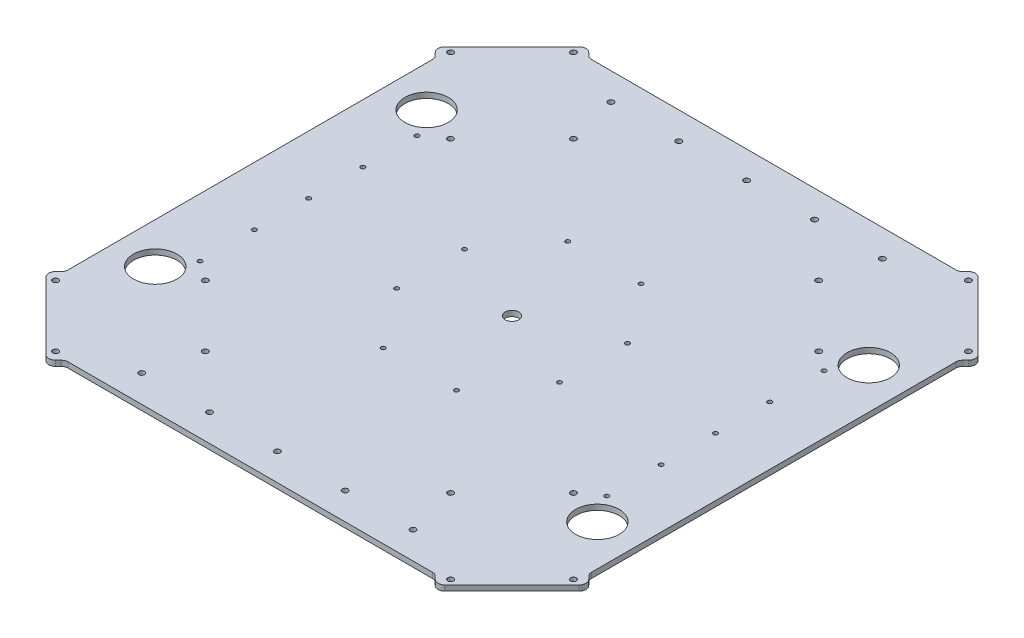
ISO-10303-21;
HEADER;
FILE_DESCRIPTION(('STEP AP214'),'2;1');
FILE_NAME('part.step','',(''),(''),'','','');
FILE_SCHEMA(('AUTOMOTIVE_DESIGN { 1 0 10303 214 1 1 1 1 }'));
ENDSEC;
DATA;
#1=APPLICATION_CONTEXT('core data for automotive mechanical design processes');
#2=APPLICATION_PROTOCOL_DEFINITION('international standard','automotive_design',2000,#1);
#3=PRODUCT_CONTEXT('',#1,'mechanical');
#4=PRODUCT('Part','Part','',(#3));
#5=PRODUCT_RELATED_PRODUCT_CATEGORY('part','',(#4));
#6=PRODUCT_DEFINITION_FORMATION('','',#4);
#7=PRODUCT_DEFINITION_CONTEXT('part definition',#1,'design');
#8=PRODUCT_DEFINITION('design','',#6,#7);
#9=PRODUCT_DEFINITION_SHAPE('','',#8);
#10=(LENGTH_UNIT() NAMED_UNIT(*) SI_UNIT(.MILLI.,.METRE.));
#11=(NAMED_UNIT(*) PLANE_ANGLE_UNIT() SI_UNIT($,.RADIAN.));
#12=(NAMED_UNIT(*) SI_UNIT($,.STERADIAN.) SOLID_ANGLE_UNIT());
#13=UNCERTAINTY_MEASURE_WITH_UNIT(LENGTH_MEASURE(1.E-05),#10,'distance_accuracy_value','');
#14=(GEOMETRIC_REPRESENTATION_CONTEXT(3) GLOBAL_UNCERTAINTY_ASSIGNED_CONTEXT((#13)) GLOBAL_UNIT_ASSIGNED_CONTEXT((#10,
#11,#12)) REPRESENTATION_CONTEXT('',''));
#15=CARTESIAN_POINT('',(0.,0.,0.));
#16=DIRECTION('',(0.,0.,1.));
#17=DIRECTION('',(1.,0.,0.));
#18=AXIS2_PLACEMENT_3D('',#15,#16,#17);
#19=CARTESIAN_POINT('',(-171.715728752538,4.,171.715728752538));
#20=DIRECTION('',(0.707106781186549,0.,-0.707106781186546));
#21=DIRECTION('',(-0.707106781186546,0.,-0.707106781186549));
#22=AXIS2_PLACEMENT_3D('',#19,#20,#21);
#23=PLANE('',#22);
#24=DIRECTION('',(0.707106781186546,0.,0.707106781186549));
#25=VECTOR('',#24,1.);
#26=CARTESIAN_POINT('',(-171.715728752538,4.,171.715728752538));
#27=LINE('',#26,#25);
#28=CARTESIAN_POINT('',(-196.464466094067,4.,146.966991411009));
#29=VERTEX_POINT('',#28);
#30=CARTESIAN_POINT('',(-146.966991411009,4.,196.464466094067));
#31=VERTEX_POINT('',#30);
#32=EDGE_CURVE('E495',#29,#31,#27,.T.);
#33=ORIENTED_EDGE('',*,*,#32,.F.);
#34=DIRECTION('',(0.,-1.,0.));
#35=VECTOR('',#34,1.);
#36=CARTESIAN_POINT('',(-196.464466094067,4.,146.966991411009));
#37=LINE('',#36,#35);
#38=CARTESIAN_POINT('',(-196.464466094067,0.,146.966991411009));
#39=VERTEX_POINT('',#38);
#40=EDGE_CURVE('E567',#29,#39,#37,.T.);
#41=ORIENTED_EDGE('',*,*,#40,.T.);
#42=DIRECTION('',(0.707106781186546,0.,0.707106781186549));
#43=VECTOR('',#42,1.);
#44=CARTESIAN_POINT('',(-171.715728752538,0.,171.715728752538));
#45=LINE('',#44,#43);
#46=CARTESIAN_POINT('',(-146.966991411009,0.,196.464466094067));
#47=VERTEX_POINT('',#46);
#48=EDGE_CURVE('E491',#39,#47,#45,.T.);
#49=ORIENTED_EDGE('',*,*,#48,.T.);
#50=DIRECTION('',(0.,-1.,0.));
#51=VECTOR('',#50,1.);
#52=CARTESIAN_POINT('',(-146.966991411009,4.,196.464466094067));
#53=LINE('',#52,#51);
#54=EDGE_CURVE('E564',#47,#31,#53,.F.);
#55=ORIENTED_EDGE('',*,*,#54,.T.);
#56=EDGE_LOOP('',(#33,#41,#49,#55));
#57=FACE_BOUND('',#56,.T.);
#58=ADVANCED_FACE('F40',(#57),#23,.F.);
#59=CARTESIAN_POINT('',(171.715728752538,4.,171.715728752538));
#60=DIRECTION('',(-0.707106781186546,0.,-0.707106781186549));
#61=DIRECTION('',(-0.707106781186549,0.,0.707106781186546));
#62=AXIS2_PLACEMENT_3D('',#59,#60,#61);
#63=PLANE('',#62);
#64=DIRECTION('',(0.707106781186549,0.,-0.707106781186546));
#65=VECTOR('',#64,1.);
#66=CARTESIAN_POINT('',(171.715728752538,4.,171.715728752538));
#67=LINE('',#66,#65);
#68=CARTESIAN_POINT('',(146.96699141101,4.,196.464466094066));
#69=VERTEX_POINT('',#68);
#70=CARTESIAN_POINT('',(196.464466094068,4.,146.966991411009));
#71=VERTEX_POINT('',#70);
#72=EDGE_CURVE('E499',#69,#71,#67,.T.);
#73=ORIENTED_EDGE('',*,*,#72,.F.);
#74=DIRECTION('',(0.,-1.,0.));
#75=VECTOR('',#74,1.);
#76=CARTESIAN_POINT('',(146.96699141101,4.,196.464466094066));
#77=LINE('',#76,#75);
#78=CARTESIAN_POINT('',(146.96699141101,0.,196.464466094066));
#79=VERTEX_POINT('',#78);
#80=EDGE_CURVE('E642',#69,#79,#77,.T.);
#81=ORIENTED_EDGE('',*,*,#80,.T.);
#82=DIRECTION('',(0.707106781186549,0.,-0.707106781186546));
#83=VECTOR('',#82,1.);
#84=CARTESIAN_POINT('',(171.715728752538,0.,171.715728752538));
#85=LINE('',#84,#83);
#86=CARTESIAN_POINT('',(196.464466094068,0.,146.966991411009));
#87=VERTEX_POINT('',#86);
#88=EDGE_CURVE('E514',#79,#87,#85,.T.);
#89=ORIENTED_EDGE('',*,*,#88,.T.);
#90=DIRECTION('',(0.,-1.,0.));
#91=VECTOR('',#90,1.);
#92=CARTESIAN_POINT('',(196.464466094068,4.,146.966991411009));
#93=LINE('',#92,#91);
#94=EDGE_CURVE('E639',#87,#71,#93,.F.);
#95=ORIENTED_EDGE('',*,*,#94,.T.);
#96=EDGE_LOOP('',(#73,#81,#89,#95));
#97=FACE_BOUND('',#96,.T.);
#98=ADVANCED_FACE('F897',(#97),#63,.F.);
#99=CARTESIAN_POINT('',(171.715728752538,4.,-171.715728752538));
#100=DIRECTION('',(-0.707106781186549,0.,0.707106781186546));
#101=DIRECTION('',(0.707106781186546,0.,0.707106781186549));
#102=AXIS2_PLACEMENT_3D('',#99,#100,#101);
#103=PLANE('',#102);
#104=DIRECTION('',(-0.707106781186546,0.,-0.707106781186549));
#105=VECTOR('',#104,1.);
#106=CARTESIAN_POINT('',(171.715728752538,4.,-171.715728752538));
#107=LINE('',#106,#105);
#108=CARTESIAN_POINT('',(196.464466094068,4.,-146.966991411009));
#109=VERTEX_POINT('',#108);
#110=CARTESIAN_POINT('',(146.966991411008,4.,-196.464466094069));
#111=VERTEX_POINT('',#110);
#112=EDGE_CURVE('E504',#109,#111,#107,.T.);
#113=ORIENTED_EDGE('',*,*,#112,.F.);
#114=DIRECTION('',(0.,-1.,0.));
#115=VECTOR('',#114,1.);
#116=CARTESIAN_POINT('',(196.464466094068,4.,-146.966991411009));
#117=LINE('',#116,#115);
#118=CARTESIAN_POINT('',(196.464466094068,0.,-146.966991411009));
#119=VERTEX_POINT('',#118);
#120=EDGE_CURVE('E670',#109,#119,#117,.T.);
#121=ORIENTED_EDGE('',*,*,#120,.T.);
#122=DIRECTION('',(-0.707106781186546,0.,-0.707106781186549));
#123=VECTOR('',#122,1.);
#124=CARTESIAN_POINT('',(171.715728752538,0.,-171.715728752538));
#125=LINE('',#124,#123);
#126=CARTESIAN_POINT('',(146.966991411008,0.,-196.464466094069));
#127=VERTEX_POINT('',#126);
#128=EDGE_CURVE('E518',#119,#127,#125,.T.);
#129=ORIENTED_EDGE('',*,*,#128,.T.);
#130=DIRECTION('',(0.,-1.,0.));
#131=VECTOR('',#130,1.);
#132=CARTESIAN_POINT('',(146.966991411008,4.,-196.464466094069));
#133=LINE('',#132,#131);
#134=EDGE_CURVE('E667',#127,#111,#133,.F.);
#135=ORIENTED_EDGE('',*,*,#134,.T.);
#136=EDGE_LOOP('',(#113,#121,#129,#135));
#137=FACE_BOUND('',#136,.T.);
#138=ADVANCED_FACE('F933',(#137),#103,.F.);
#139=CARTESIAN_POINT('',(-171.715728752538,4.,-171.715728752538));
#140=DIRECTION('',(0.707106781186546,0.,0.707106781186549));
#141=DIRECTION('',(0.707106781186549,0.,-0.707106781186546));
#142=AXIS2_PLACEMENT_3D('',#139,#140,#141);
#143=PLANE('',#142);
#144=DIRECTION('',(-0.707106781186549,0.,0.707106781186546));
#145=VECTOR('',#144,1.);
#146=CARTESIAN_POINT('',(-171.715728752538,4.,-171.715728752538));
#147=LINE('',#146,#145);
#148=CARTESIAN_POINT('',(-146.966991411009,4.,-196.464466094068));
#149=VERTEX_POINT('',#148);
#150=CARTESIAN_POINT('',(-196.464466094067,4.,-146.966991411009));
#151=VERTEX_POINT('',#150);
#152=EDGE_CURVE('E508',#149,#151,#147,.T.);
#153=ORIENTED_EDGE('',*,*,#152,.F.);
#154=DIRECTION('',(0.,-1.,0.));
#155=VECTOR('',#154,1.);
#156=CARTESIAN_POINT('',(-146.966991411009,4.,-196.464466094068));
#157=LINE('',#156,#155);
#158=CARTESIAN_POINT('',(-146.966991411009,0.,-196.464466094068));
#159=VERTEX_POINT('',#158);
#160=EDGE_CURVE('E697',#149,#159,#157,.T.);
#161=ORIENTED_EDGE('',*,*,#160,.T.);
#162=DIRECTION('',(-0.707106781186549,0.,0.707106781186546));
#163=VECTOR('',#162,1.);
#164=CARTESIAN_POINT('',(-171.715728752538,0.,-171.715728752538));
#165=LINE('',#164,#163);
#166=CARTESIAN_POINT('',(-196.464466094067,0.,-146.966991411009));
#167=VERTEX_POINT('',#166);
#168=EDGE_CURVE('E500',#159,#167,#165,.T.);
#169=ORIENTED_EDGE('',*,*,#168,.T.);
#170=DIRECTION('',(0.,-1.,0.));
#171=VECTOR('',#170,1.);
#172=CARTESIAN_POINT('',(-196.464466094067,4.,-146.966991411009));
#173=LINE('',#172,#171);
#174=EDGE_CURVE('E56',#167,#151,#173,.F.);
#175=ORIENTED_EDGE('',*,*,#174,.T.);
#176=EDGE_LOOP('',(#153,#161,#169,#175));
#177=FACE_BOUND('',#176,.T.);
#178=ADVANCED_FACE('F964',(#177),#143,.F.);
#179=CARTESIAN_POINT('',(0.,4.,0.));
#180=DIRECTION('',(0.,1.,0.));
#181=DIRECTION('',(0.,0.,1.));
#182=AXIS2_PLACEMENT_3D('',#179,#180,#181);
#183=PLANE('',#182);
#184=CARTESIAN_POINT('',(-60.,4.,25.));
#185=DIRECTION('',(0.,1.,0.));
#186=DIRECTION('',(0.,0.,1.));
#187=AXIS2_PLACEMENT_3D('',#184,#185,#186);
#188=CIRCLE('',#187,1.6);
#189=CARTESIAN_POINT('',(-60.,4.,26.6));
#190=VERTEX_POINT('',#189);
#191=EDGE_CURVE('E1816',#190,#190,#188,.T.);
#192=ORIENTED_EDGE('',*,*,#191,.F.);
#193=EDGE_LOOP('',(#192));
#194=FACE_BOUND('',#193,.T.);
#195=CARTESIAN_POINT('',(60.,4.,25.));
#196=DIRECTION('',(0.,1.,0.));
#197=DIRECTION('',(0.,0.,-1.));
#198=AXIS2_PLACEMENT_3D('',#195,#196,#197);
#199=CIRCLE('',#198,1.6);
#200=CARTESIAN_POINT('',(60.,4.,23.4));
#201=VERTEX_POINT('',#200);
#202=EDGE_CURVE('E753',#201,#201,#199,.T.);
#203=ORIENTED_EDGE('',*,*,#202,.F.);
#204=EDGE_LOOP('',(#203));
#205=FACE_BOUND('',#204,.T.);
#206=CARTESIAN_POINT('',(27.,4.,68.));
#207=DIRECTION('',(0.,1.,0.));
#208=DIRECTION('',(0.,0.,-1.));
#209=AXIS2_PLACEMENT_3D('',#206,#207,#208);
#210=CIRCLE('',#209,1.6);
#211=CARTESIAN_POINT('',(27.,4.,66.4));
#212=VERTEX_POINT('',#211);
#213=EDGE_CURVE('E750',#212,#212,#210,.T.);
#214=ORIENTED_EDGE('',*,*,#213,.F.);
#215=EDGE_LOOP('',(#214));
#216=FACE_BOUND('',#215,.T.);
#217=CARTESIAN_POINT('',(60.,4.,-25.));
#218=DIRECTION('',(0.,1.,0.));
#219=DIRECTION('',(0.,0.,1.));
#220=AXIS2_PLACEMENT_3D('',#217,#218,#219);
#221=CIRCLE('',#220,1.6);
#222=CARTESIAN_POINT('',(60.,4.,-23.4));
#223=VERTEX_POINT('',#222);
#224=EDGE_CURVE('E747',#223,#223,#221,.T.);
#225=ORIENTED_EDGE('',*,*,#224,.F.);
#226=EDGE_LOOP('',(#225));
#227=FACE_BOUND('',#226,.T.);
#228=CARTESIAN_POINT('',(-27.,4.,68.));
#229=DIRECTION('',(0.,1.,0.));
#230=DIRECTION('',(0.,0.,1.));
#231=AXIS2_PLACEMENT_3D('',#228,#229,#230);
#232=CIRCLE('',#231,1.6);
#233=CARTESIAN_POINT('',(-27.,4.,69.6));
#234=VERTEX_POINT('',#233);
#235=EDGE_CURVE('E1827',#234,#234,#232,.T.);
#236=ORIENTED_EDGE('',*,*,#235,.F.);
#237=EDGE_LOOP('',(#236));
#238=FACE_BOUND('',#237,.T.);
#239=CARTESIAN_POINT('',(-27.,4.,-68.));
#240=DIRECTION('',(0.,1.,0.));
#241=DIRECTION('',(0.,0.,-1.));
#242=AXIS2_PLACEMENT_3D('',#239,#240,#241);
#243=CIRCLE('',#242,1.6);
#244=CARTESIAN_POINT('',(-27.,4.,-69.6));
#245=VERTEX_POINT('',#244);
#246=EDGE_CURVE('E1831',#245,#245,#243,.T.);
#247=ORIENTED_EDGE('',*,*,#246,.F.);
#248=EDGE_LOOP('',(#247));
#249=FACE_BOUND('',#248,.T.);
#250=CARTESIAN_POINT('',(-60.,4.,-25.));
#251=DIRECTION('',(0.,1.,0.));
#252=DIRECTION('',(0.,0.,-1.));
#253=AXIS2_PLACEMENT_3D('',#250,#251,#252);
#254=CIRCLE('',#253,1.6);
#255=CARTESIAN_POINT('',(-60.,4.,-26.6));
#256=VERTEX_POINT('',#255);
#257=EDGE_CURVE('E1835',#256,#256,#254,.T.);
#258=ORIENTED_EDGE('',*,*,#257,.F.);
#259=EDGE_LOOP('',(#258));
#260=FACE_BOUND('',#259,.T.);
#261=CARTESIAN_POINT('',(27.,4.,-68.));
#262=DIRECTION('',(0.,1.,0.));
#263=DIRECTION('',(0.,0.,1.));
#264=AXIS2_PLACEMENT_3D('',#261,#262,#263);
#265=CIRCLE('',#264,1.6);
#266=CARTESIAN_POINT('',(27.,4.,-66.4));
#267=VERTEX_POINT('',#266);
#268=EDGE_CURVE('E529',#267,#267,#265,.T.);
#269=ORIENTED_EDGE('',*,*,#268,.F.);
#270=EDGE_LOOP('',(#269));
#271=FACE_BOUND('',#270,.T.);
#272=CARTESIAN_POINT('',(50.,4.,-172.928932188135));
#273=DIRECTION('',(0.,1.,0.));
#274=DIRECTION('',(0.,0.,1.));
#275=AXIS2_PLACEMENT_3D('',#272,#273,#274);
#276=CIRCLE('',#275,2.09999999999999);
#277=CARTESIAN_POINT('',(50.,4.,-170.828932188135));
#278=VERTEX_POINT('',#277);
#279=EDGE_CURVE('E1842',#278,#278,#276,.T.);
#280=ORIENTED_EDGE('',*,*,#279,.F.);
#281=EDGE_LOOP('',(#280));
#282=FACE_BOUND('',#281,.T.);
#283=CARTESIAN_POINT('',(100.,4.,-172.928932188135));
#284=DIRECTION('',(0.,1.,0.));
#285=DIRECTION('',(0.,0.,1.));
#286=AXIS2_PLACEMENT_3D('',#283,#284,#285);
#287=CIRCLE('',#286,2.1);
#288=CARTESIAN_POINT('',(100.,4.,-170.828932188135));
#289=VERTEX_POINT('',#288);
#290=EDGE_CURVE('E1846',#289,#289,#287,.T.);
#291=ORIENTED_EDGE('',*,*,#290,.F.);
#292=EDGE_LOOP('',(#291));
#293=FACE_BOUND('',#292,.T.);
#294=CARTESIAN_POINT('',(-100.000000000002,4.,-172.928932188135));
#295=DIRECTION('',(0.,1.,0.));
#296=DIRECTION('',(0.,0.,-1.));
#297=AXIS2_PLACEMENT_3D('',#294,#295,#296);
#298=CIRCLE('',#297,2.1);
#299=CARTESIAN_POINT('',(-100.000000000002,4.,-175.028932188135));
#300=VERTEX_POINT('',#299);
#301=EDGE_CURVE('E1850',#300,#300,#298,.T.);
#302=ORIENTED_EDGE('',*,*,#301,.F.);
#303=EDGE_LOOP('',(#302));
#304=FACE_BOUND('',#303,.T.);
#305=CARTESIAN_POINT('',(-50.0000000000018,4.,-172.928932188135));
#306=DIRECTION('',(0.,1.,0.));
#307=DIRECTION('',(0.,0.,-1.));
#308=AXIS2_PLACEMENT_3D('',#305,#306,#307);
#309=CIRCLE('',#308,2.09999999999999);
#310=CARTESIAN_POINT('',(-50.0000000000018,4.,-175.028932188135));
#311=VERTEX_POINT('',#310);
#312=EDGE_CURVE('E768',#311,#311,#309,.T.);
#313=ORIENTED_EDGE('',*,*,#312,.F.);
#314=EDGE_LOOP('',(#313));
#315=FACE_BOUND('',#314,.T.);
#316=CARTESIAN_POINT('',(-50.,4.,172.928932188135));
#317=DIRECTION('',(0.,1.,0.));
#318=DIRECTION('',(0.,0.,1.));
#319=AXIS2_PLACEMENT_3D('',#316,#317,#318);
#320=CIRCLE('',#319,2.09999999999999);
#321=CARTESIAN_POINT('',(-50.,4.,175.028932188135));
#322=VERTEX_POINT('',#321);
#323=EDGE_CURVE('E769',#322,#322,#320,.T.);
#324=ORIENTED_EDGE('',*,*,#323,.F.);
#325=EDGE_LOOP('',(#324));
#326=FACE_BOUND('',#325,.T.);
#327=CARTESIAN_POINT('',(-100.,4.,172.928932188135));
#328=DIRECTION('',(0.,1.,0.));
#329=DIRECTION('',(0.,0.,1.));
#330=AXIS2_PLACEMENT_3D('',#327,#328,#329);
#331=CIRCLE('',#330,2.1);
#332=CARTESIAN_POINT('',(-100.,4.,175.028932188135));
#333=VERTEX_POINT('',#332);
#334=EDGE_CURVE('E1860',#333,#333,#331,.T.);
#335=ORIENTED_EDGE('',*,*,#334,.F.);
#336=EDGE_LOOP('',(#335));
#337=FACE_BOUND('',#336,.T.);
#338=CARTESIAN_POINT('',(100.,4.,172.928932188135));
#339=DIRECTION('',(0.,1.,0.));
#340=DIRECTION('',(0.,0.,-1.));
#341=AXIS2_PLACEMENT_3D('',#338,#339,#340);
#342=CIRCLE('',#341,2.1);
#343=CARTESIAN_POINT('',(100.,4.,170.828932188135));
#344=VERTEX_POINT('',#343);
#345=EDGE_CURVE('E1864',#344,#344,#342,.T.);
#346=ORIENTED_EDGE('',*,*,#345,.F.);
#347=EDGE_LOOP('',(#346));
#348=FACE_BOUND('',#347,.T.);
#349=CARTESIAN_POINT('',(50.,4.,172.928932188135));
#350=DIRECTION('',(0.,1.,0.));
#351=DIRECTION('',(0.,0.,-1.));
#352=AXIS2_PLACEMENT_3D('',#349,#350,#351);
#353=CIRCLE('',#352,2.09999999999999);
#354=CARTESIAN_POINT('',(50.,4.,170.828932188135));
#355=VERTEX_POINT('',#354);
#356=EDGE_CURVE('E1868',#355,#355,#353,.T.);
#357=ORIENTED_EDGE('',*,*,#356,.F.);
#358=EDGE_LOOP('',(#357));
#359=FACE_BOUND('',#358,.T.);
#360=CARTESIAN_POINT('',(0.,4.,172.928932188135));
#361=DIRECTION('',(0.,1.,0.));
#362=DIRECTION('',(0.,0.,-1.));
#363=AXIS2_PLACEMENT_3D('',#360,#361,#362);
#364=CIRCLE('',#363,2.1);
#365=CARTESIAN_POINT('',(0.,4.,170.828932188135));
#366=VERTEX_POINT('',#365);
#367=EDGE_CURVE('E557',#366,#366,#364,.T.);
#368=ORIENTED_EDGE('',*,*,#367,.F.);
#369=EDGE_LOOP('',(#368));
#370=FACE_BOUND('',#369,.T.);
#371=CARTESIAN_POINT('',(0.,4.,-172.928932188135));
#372=DIRECTION('',(0.,1.,0.));
#373=DIRECTION('',(0.,0.,1.));
#374=AXIS2_PLACEMENT_3D('',#371,#372,#373);
#375=CIRCLE('',#374,2.1);
#376=CARTESIAN_POINT('',(0.,4.,-170.828932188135));
#377=VERTEX_POINT('',#376);
#378=EDGE_CURVE('E1875',#377,#377,#375,.T.);
#379=ORIENTED_EDGE('',*,*,#378,.F.);
#380=EDGE_LOOP('',(#379));
#381=FACE_BOUND('',#380,.T.);
#382=CARTESIAN_POINT('',(149.928932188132,4.,80.0000000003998));
#383=DIRECTION('',(0.,-1.,0.));
#384=DIRECTION('',(0.,0.,1.));
#385=AXIS2_PLACEMENT_3D('',#382,#383,#384);
#386=CIRCLE('',#385,1.59999999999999);
#387=CARTESIAN_POINT('',(149.928932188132,4.,81.6000000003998));
#388=VERTEX_POINT('',#387);
#389=EDGE_CURVE('E789',#388,#388,#386,.T.);
#390=ORIENTED_EDGE('',*,*,#389,.T.);
#391=EDGE_LOOP('',(#390));
#392=FACE_BOUND('',#391,.T.);
#393=CARTESIAN_POINT('',(-149.928932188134,4.,-39.999999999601));
#394=DIRECTION('',(0.,-1.,0.));
#395=DIRECTION('',(0.,0.,-1.));
#396=AXIS2_PLACEMENT_3D('',#393,#394,#395);
#397=CIRCLE('',#396,1.59999999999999);
#398=CARTESIAN_POINT('',(-149.928932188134,4.,-41.599999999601));
#399=VERTEX_POINT('',#398);
#400=EDGE_CURVE('E1881',#399,#399,#397,.T.);
#401=ORIENTED_EDGE('',*,*,#400,.T.);
#402=EDGE_LOOP('',(#401));
#403=FACE_BOUND('',#402,.T.);
#404=CARTESIAN_POINT('',(-149.928932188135,4.,3.9895864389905E-10));
#405=DIRECTION('',(0.,-1.,0.));
#406=DIRECTION('',(0.,0.,-1.));
#407=AXIS2_PLACEMENT_3D('',#404,#405,#406);
#408=CIRCLE('',#407,1.59999999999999);
#409=CARTESIAN_POINT('',(-149.928932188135,4.,-1.59999999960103));
#410=VERTEX_POINT('',#409);
#411=EDGE_CURVE('E785',#410,#410,#408,.T.);
#412=ORIENTED_EDGE('',*,*,#411,.T.);
#413=EDGE_LOOP('',(#412));
#414=FACE_BOUND('',#413,.T.);
#415=CARTESIAN_POINT('',(-149.928932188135,4.,40.000000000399));
#416=DIRECTION('',(0.,-1.,0.));
#417=DIRECTION('',(0.,0.,-1.));
#418=AXIS2_PLACEMENT_3D('',#415,#416,#417);
#419=CIRCLE('',#418,1.59999999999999);
#420=CARTESIAN_POINT('',(-149.928932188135,4.,38.400000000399));
#421=VERTEX_POINT('',#420);
#422=EDGE_CURVE('E764',#421,#421,#419,.T.);
#423=ORIENTED_EDGE('',*,*,#422,.T.);
#424=EDGE_LOOP('',(#423));
#425=FACE_BOUND('',#424,.T.);
#426=CARTESIAN_POINT('',(149.928932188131,4.,-79.9999999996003));
#427=DIRECTION('',(0.,-1.,0.));
#428=DIRECTION('',(0.,0.,1.));
#429=AXIS2_PLACEMENT_3D('',#426,#427,#428);
#430=CIRCLE('',#429,1.59999999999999);
#431=CARTESIAN_POINT('',(149.928932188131,4.,-78.3999999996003));
#432=VERTEX_POINT('',#431);
#433=EDGE_CURVE('E763',#432,#432,#430,.T.);
#434=ORIENTED_EDGE('',*,*,#433,.T.);
#435=EDGE_LOOP('',(#434));
#436=FACE_BOUND('',#435,.T.);
#437=CARTESIAN_POINT('',(-149.928932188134,4.,-79.999999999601));
#438=DIRECTION('',(0.,-1.,0.));
#439=DIRECTION('',(0.,0.,-1.));
#440=AXIS2_PLACEMENT_3D('',#437,#438,#439);
#441=CIRCLE('',#440,1.59999999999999);
#442=CARTESIAN_POINT('',(-149.928932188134,4.,-81.599999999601));
#443=VERTEX_POINT('',#442);
#444=EDGE_CURVE('E1891',#443,#443,#441,.T.);
#445=ORIENTED_EDGE('',*,*,#444,.T.);
#446=EDGE_LOOP('',(#445));
#447=FACE_BOUND('',#446,.T.);
#448=CARTESIAN_POINT('',(149.928932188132,4.,-39.9999999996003));
#449=DIRECTION('',(0.,-1.,0.));
#450=DIRECTION('',(0.,0.,1.));
#451=AXIS2_PLACEMENT_3D('',#448,#449,#450);
#452=CIRCLE('',#451,1.59999999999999);
#453=CARTESIAN_POINT('',(149.928932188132,4.,-38.3999999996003));
#454=VERTEX_POINT('',#453);
#455=EDGE_CURVE('E1895',#454,#454,#452,.T.);
#456=ORIENTED_EDGE('',*,*,#455,.T.);
#457=EDGE_LOOP('',(#456));
#458=FACE_BOUND('',#457,.T.);
#459=CARTESIAN_POINT('',(149.928932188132,4.,3.99735800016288E-10));
#460=DIRECTION('',(0.,-1.,0.));
#461=DIRECTION('',(0.,0.,1.));
#462=AXIS2_PLACEMENT_3D('',#459,#460,#461);
#463=CIRCLE('',#462,1.59999999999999);
#464=CARTESIAN_POINT('',(149.928932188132,4.,1.60000000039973));
#465=VERTEX_POINT('',#464);
#466=EDGE_CURVE('E1899',#465,#465,#463,.T.);
#467=ORIENTED_EDGE('',*,*,#466,.T.);
#468=EDGE_LOOP('',(#467));
#469=FACE_BOUND('',#468,.T.);
#470=CARTESIAN_POINT('',(149.928932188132,4.,40.0000000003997));
#471=DIRECTION('',(0.,-1.,0.));
#472=DIRECTION('',(0.,0.,1.));
#473=AXIS2_PLACEMENT_3D('',#470,#471,#472);
#474=CIRCLE('',#473,1.59999999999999);
#475=CARTESIAN_POINT('',(149.928932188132,4.,41.6000000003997));
#476=VERTEX_POINT('',#475);
#477=EDGE_CURVE('E1903',#476,#476,#474,.T.);
#478=ORIENTED_EDGE('',*,*,#477,.T.);
#479=EDGE_LOOP('',(#478));
#480=FACE_BOUND('',#479,.T.);
#481=CARTESIAN_POINT('',(-149.928932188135,4.,80.000000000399));
#482=DIRECTION('',(0.,-1.,0.));
#483=DIRECTION('',(0.,0.,-1.));
#484=AXIS2_PLACEMENT_3D('',#481,#482,#483);
#485=CIRCLE('',#484,1.60000000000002);
#486=CARTESIAN_POINT('',(-149.928932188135,4.,78.4000000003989));
#487=VERTEX_POINT('',#486);
#488=EDGE_CURVE('E772',#487,#487,#485,.T.);
#489=ORIENTED_EDGE('',*,*,#488,.T.);
#490=EDGE_LOOP('',(#489));
#491=FACE_BOUND('',#490,.T.);
#492=CARTESIAN_POINT('',(-162.928932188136,4.,99.9999999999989));
#493=DIRECTION('',(0.,-1.,0.));
#494=DIRECTION('',(0.,0.,1.));
#495=AXIS2_PLACEMENT_3D('',#492,#493,#494);
#496=CIRCLE('',#495,15.9999999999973);
#497=CARTESIAN_POINT('',(-162.928932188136,4.,115.999999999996));
#498=VERTEX_POINT('',#497);
#499=EDGE_CURVE('E819',#498,#498,#496,.T.);
#500=ORIENTED_EDGE('',*,*,#499,.T.);
#501=EDGE_LOOP('',(#500));
#502=FACE_BOUND('',#501,.T.);
#503=CARTESIAN_POINT('',(-162.928932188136,4.,-99.9999999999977));
#504=DIRECTION('',(0.,-1.,0.));
#505=DIRECTION('',(0.,0.,1.));
#506=AXIS2_PLACEMENT_3D('',#503,#504,#505);
#507=CIRCLE('',#506,16.);
#508=CARTESIAN_POINT('',(-162.928932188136,4.,-83.9999999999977));
#509=VERTEX_POINT('',#508);
#510=EDGE_CURVE('E811',#509,#509,#507,.T.);
#511=ORIENTED_EDGE('',*,*,#510,.T.);
#512=EDGE_LOOP('',(#511));
#513=FACE_BOUND('',#512,.T.);
#514=CARTESIAN_POINT('',(162.928932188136,4.,-100.000000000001));
#515=DIRECTION('',(0.,-1.,0.));
#516=DIRECTION('',(0.,0.,-1.));
#517=AXIS2_PLACEMENT_3D('',#514,#515,#516);
#518=CIRCLE('',#517,16.);
#519=CARTESIAN_POINT('',(162.928932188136,4.,-116.000000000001));
#520=VERTEX_POINT('',#519);
#521=EDGE_CURVE('E802',#520,#520,#518,.T.);
#522=ORIENTED_EDGE('',*,*,#521,.T.);
#523=EDGE_LOOP('',(#522));
#524=FACE_BOUND('',#523,.T.);
#525=CARTESIAN_POINT('',(162.928932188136,4.,99.9999999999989));
#526=DIRECTION('',(0.,-1.,0.));
#527=DIRECTION('',(0.,0.,-1.));
#528=AXIS2_PLACEMENT_3D('',#525,#526,#527);
#529=CIRCLE('',#528,16.);
#530=CARTESIAN_POINT('',(162.928932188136,4.,83.9999999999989));
#531=VERTEX_POINT('',#530);
#532=EDGE_CURVE('E826',#531,#531,#529,.T.);
#533=ORIENTED_EDGE('',*,*,#532,.T.);
#534=EDGE_LOOP('',(#533));
#535=FACE_BOUND('',#534,.T.);
#536=CARTESIAN_POINT('',(0.,4.,0.));
#537=DIRECTION('',(0.,1.,0.));
#538=DIRECTION('',(0.,0.,1.));
#539=AXIS2_PLACEMENT_3D('',#536,#537,#538);
#540=CIRCLE('',#539,5.);
#541=CARTESIAN_POINT('',(0.,4.,5.));
#542=VERTEX_POINT('',#541);
#543=EDGE_CURVE('E758',#542,#542,#540,.T.);
#544=ORIENTED_EDGE('',*,*,#543,.F.);
#545=EDGE_LOOP('',(#544));
#546=FACE_BOUND('',#545,.T.);
#547=DIRECTION('',(0.707106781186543,0.,-0.707106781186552));
#548=VECTOR('',#547,1.);
#549=CARTESIAN_POINT('',(-200.,4.,143.431457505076));
#550=LINE('',#549,#548);
#551=CARTESIAN_POINT('',(-196.464466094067,4.,139.895923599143));
#552=VERTEX_POINT('',#551);
#553=CARTESIAN_POINT('',(-194.393398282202,4.,137.824855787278));
#554=VERTEX_POINT('',#553);
#555=EDGE_CURVE('E281',#552,#554,#550,.T.);
#556=ORIENTED_EDGE('',*,*,#555,.F.);
#557=CARTESIAN_POINT('',(-192.928932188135,4.,143.431457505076));
#558=DIRECTION('',(0.,1.,0.));
#559=DIRECTION('',(0.,0.,1.));
#560=AXIS2_PLACEMENT_3D('',#557,#558,#559);
#561=CIRCLE('',#560,5.);
#562=EDGE_CURVE('E615',#552,#29,#561,.T.);
#563=ORIENTED_EDGE('',*,*,#562,.T.);
#564=ORIENTED_EDGE('',*,*,#32,.T.);
#565=CARTESIAN_POINT('',(-143.431457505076,4.,192.928932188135));
#566=DIRECTION('',(0.,1.,0.));
#567=DIRECTION('',(0.,0.,1.));
#568=AXIS2_PLACEMENT_3D('',#565,#566,#567);
#569=CIRCLE('',#568,5.);
#570=CARTESIAN_POINT('',(-139.895923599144,4.,196.464466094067));
#571=VERTEX_POINT('',#570);
#572=EDGE_CURVE('E612',#31,#571,#569,.T.);
#573=ORIENTED_EDGE('',*,*,#572,.T.);
#574=DIRECTION('',(-0.707106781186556,0.,0.707106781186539));
#575=VECTOR('',#574,1.);
#576=CARTESIAN_POINT('',(-143.431457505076,4.,200.));
#577=LINE('',#576,#575);
#578=CARTESIAN_POINT('',(-137.824855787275,4.,194.393398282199));
#579=VERTEX_POINT('',#578);
#580=EDGE_CURVE('E347',#579,#571,#577,.T.);
#581=ORIENTED_EDGE('',*,*,#580,.F.);
#582=CARTESIAN_POINT('',(-134.289321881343,4.,197.928932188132));
#583=DIRECTION('',(0.,1.,0.));
#584=DIRECTION('',(0.,0.,1.));
#585=AXIS2_PLACEMENT_3D('',#582,#583,#584);
#586=CIRCLE('',#585,5.);
#587=CARTESIAN_POINT('',(-134.289321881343,4.,192.928932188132));
#588=VERTEX_POINT('',#587);
#589=EDGE_CURVE('E710',#579,#588,#586,.F.);
#590=ORIENTED_EDGE('',*,*,#589,.T.);
#591=DIRECTION('',(-1.,0.,0.));
#592=VECTOR('',#591,1.);
#593=CARTESIAN_POINT('',(-136.360389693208,4.,192.928932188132));
#594=LINE('',#593,#592);
#595=CARTESIAN_POINT('',(134.289321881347,4.,192.928932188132));
#596=VERTEX_POINT('',#595);
#597=EDGE_CURVE('E358',#596,#588,#594,.T.);
#598=ORIENTED_EDGE('',*,*,#597,.F.);
#599=CARTESIAN_POINT('',(134.289321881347,4.,197.928932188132));
#600=DIRECTION('',(0.,1.,0.));
#601=DIRECTION('',(0.,0.,1.));
#602=AXIS2_PLACEMENT_3D('',#599,#600,#601);
#603=CIRCLE('',#602,5.);
#604=CARTESIAN_POINT('',(137.824855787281,4.,194.3933982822));
#605=VERTEX_POINT('',#604);
#606=EDGE_CURVE('E716',#596,#605,#603,.F.);
#607=ORIENTED_EDGE('',*,*,#606,.T.);
#608=DIRECTION('',(-0.707106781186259,0.,-0.707106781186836));
#609=VECTOR('',#608,1.);
#610=CARTESIAN_POINT('',(143.431457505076,4.,200.));
#611=LINE('',#610,#609);
#612=CARTESIAN_POINT('',(139.895923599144,4.,196.464466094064));
#613=VERTEX_POINT('',#612);
#614=EDGE_CURVE('E354',#613,#605,#611,.T.);
#615=ORIENTED_EDGE('',*,*,#614,.F.);
#616=CARTESIAN_POINT('',(143.431457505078,4.,192.928932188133));
#617=DIRECTION('',(0.,1.,0.));
#618=DIRECTION('',(0.,0.,1.));
#619=AXIS2_PLACEMENT_3D('',#616,#617,#618);
#620=CIRCLE('',#619,5.);
#621=EDGE_CURVE('E609',#613,#69,#620,.T.);
#622=ORIENTED_EDGE('',*,*,#621,.T.);
#623=ORIENTED_EDGE('',*,*,#72,.T.);
#624=CARTESIAN_POINT('',(192.928932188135,4.,143.431457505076));
#625=DIRECTION('',(0.,1.,0.));
#626=DIRECTION('',(0.,0.,1.));
#627=AXIS2_PLACEMENT_3D('',#624,#625,#626);
#628=CIRCLE('',#627,5.);
#629=CARTESIAN_POINT('',(196.464466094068,4.,139.895923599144));
#630=VERTEX_POINT('',#629);
#631=EDGE_CURVE('E606',#71,#630,#628,.T.);
#632=ORIENTED_EDGE('',*,*,#631,.T.);
#633=DIRECTION('',(0.707106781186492,0.,0.707106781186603));
#634=VECTOR('',#633,1.);
#635=CARTESIAN_POINT('',(200.,4.,143.431457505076));
#636=LINE('',#635,#634);
#637=CARTESIAN_POINT('',(194.393398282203,4.,137.824855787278));
#638=VERTEX_POINT('',#637);
#639=EDGE_CURVE('E323',#638,#630,#636,.T.);
#640=ORIENTED_EDGE('',*,*,#639,.F.);
#641=CARTESIAN_POINT('',(197.928932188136,4.,134.289321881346));
#642=DIRECTION('',(0.,1.,0.));
#643=DIRECTION('',(0.,0.,1.));
#644=AXIS2_PLACEMENT_3D('',#641,#642,#643);
#645=CIRCLE('',#644,5.);
#646=CARTESIAN_POINT('',(192.928932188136,4.,134.289321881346));
#647=VERTEX_POINT('',#646);
#648=EDGE_CURVE('E722',#638,#647,#645,.F.);
#649=ORIENTED_EDGE('',*,*,#648,.T.);
#650=DIRECTION('',(0.,0.,1.));
#651=VECTOR('',#650,1.);
#652=CARTESIAN_POINT('',(192.928932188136,4.,136.360389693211));
#653=LINE('',#652,#651);
#654=CARTESIAN_POINT('',(192.928932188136,4.,-134.289321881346));
#655=VERTEX_POINT('',#654);
#656=EDGE_CURVE('E334',#655,#647,#653,.T.);
#657=ORIENTED_EDGE('',*,*,#656,.F.);
#658=CARTESIAN_POINT('',(197.928932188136,4.,-134.289321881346));
#659=DIRECTION('',(0.,1.,0.));
#660=DIRECTION('',(0.,0.,1.));
#661=AXIS2_PLACEMENT_3D('',#658,#659,#660);
#662=CIRCLE('',#661,5.);
#663=CARTESIAN_POINT('',(194.393398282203,4.,-137.824855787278));
#664=VERTEX_POINT('',#663);
#665=EDGE_CURVE('E728',#655,#664,#662,.F.);
#666=ORIENTED_EDGE('',*,*,#665,.T.);
#667=DIRECTION('',(-0.707106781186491,0.,0.707106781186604));
#668=VECTOR('',#667,1.);
#669=CARTESIAN_POINT('',(200.,4.,-143.431457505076));
#670=LINE('',#669,#668);
#671=CARTESIAN_POINT('',(196.464466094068,4.,-139.895923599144));
#672=VERTEX_POINT('',#671);
#673=EDGE_CURVE('E330',#672,#664,#670,.T.);
#674=ORIENTED_EDGE('',*,*,#673,.F.);
#675=CARTESIAN_POINT('',(192.928932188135,4.,-143.431457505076));
#676=DIRECTION('',(0.,1.,0.));
#677=DIRECTION('',(0.,0.,1.));
#678=AXIS2_PLACEMENT_3D('',#675,#676,#677);
#679=CIRCLE('',#678,5.);
#680=EDGE_CURVE('E603',#672,#109,#679,.T.);
#681=ORIENTED_EDGE('',*,*,#680,.T.);
#682=ORIENTED_EDGE('',*,*,#112,.T.);
#683=CARTESIAN_POINT('',(143.431457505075,4.,-192.928932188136));
#684=DIRECTION('',(0.,1.,0.));
#685=DIRECTION('',(0.,0.,1.));
#686=AXIS2_PLACEMENT_3D('',#683,#684,#685);
#687=CIRCLE('',#686,5.);
#688=CARTESIAN_POINT('',(139.895923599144,4.,-196.46446609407));
#689=VERTEX_POINT('',#688);
#690=EDGE_CURVE('E600',#111,#689,#687,.T.);
#691=ORIENTED_EDGE('',*,*,#690,.T.);
#692=DIRECTION('',(0.70710678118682,0.,-0.707106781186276));
#693=VECTOR('',#692,1.);
#694=CARTESIAN_POINT('',(143.431457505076,4.,-200.));
#695=LINE('',#694,#693);
#696=CARTESIAN_POINT('',(137.824855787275,4.,-194.393398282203));
#697=VERTEX_POINT('',#696);
#698=EDGE_CURVE('E299',#697,#689,#695,.T.);
#699=ORIENTED_EDGE('',*,*,#698,.F.);
#700=CARTESIAN_POINT('',(134.289321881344,4.,-197.928932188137));
#701=DIRECTION('',(0.,1.,0.));
#702=DIRECTION('',(0.,0.,1.));
#703=AXIS2_PLACEMENT_3D('',#700,#701,#702);
#704=CIRCLE('',#703,5.);
#705=CARTESIAN_POINT('',(134.289321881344,4.,-192.928932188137));
#706=VERTEX_POINT('',#705);
#707=EDGE_CURVE('E734',#697,#706,#704,.F.);
#708=ORIENTED_EDGE('',*,*,#707,.T.);
#709=DIRECTION('',(1.,0.,0.));
#710=VECTOR('',#709,1.);
#711=CARTESIAN_POINT('',(136.360389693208,4.,-192.928932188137));
#712=LINE('',#711,#710);
#713=CARTESIAN_POINT('',(-134.289321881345,4.,-192.928932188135));
#714=VERTEX_POINT('',#713);
#715=EDGE_CURVE('E310',#714,#706,#712,.T.);
#716=ORIENTED_EDGE('',*,*,#715,.F.);
#717=CARTESIAN_POINT('',(-134.289321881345,4.,-197.928932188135));
#718=DIRECTION('',(0.,1.,0.));
#719=DIRECTION('',(0.,0.,1.));
#720=AXIS2_PLACEMENT_3D('',#717,#718,#719);
#721=CIRCLE('',#720,5.);
#722=CARTESIAN_POINT('',(-137.824855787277,4.,-194.393398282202));
#723=VERTEX_POINT('',#722);
#724=EDGE_CURVE('E740',#714,#723,#721,.F.);
#725=ORIENTED_EDGE('',*,*,#724,.T.);
#726=DIRECTION('',(0.707106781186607,0.,0.707106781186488));
#727=VECTOR('',#726,1.);
#728=CARTESIAN_POINT('',(-143.431457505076,4.,-200.));
#729=LINE('',#728,#727);
#730=CARTESIAN_POINT('',(-139.895923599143,4.,-196.464466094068));
#731=VERTEX_POINT('',#730);
#732=EDGE_CURVE('E306',#731,#723,#729,.T.);
#733=ORIENTED_EDGE('',*,*,#732,.F.);
#734=CARTESIAN_POINT('',(-143.431457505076,4.,-192.928932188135));
#735=DIRECTION('',(0.,1.,0.));
#736=DIRECTION('',(0.,0.,1.));
#737=AXIS2_PLACEMENT_3D('',#734,#735,#736);
#738=CIRCLE('',#737,5.);
#739=EDGE_CURVE('E63',#731,#149,#738,.T.);
#740=ORIENTED_EDGE('',*,*,#739,.T.);
#741=ORIENTED_EDGE('',*,*,#152,.T.);
#742=CARTESIAN_POINT('',(-192.928932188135,4.,-143.431457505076));
#743=DIRECTION('',(0.,1.,0.));
#744=DIRECTION('',(0.,0.,1.));
#745=AXIS2_PLACEMENT_3D('',#742,#743,#744);
#746=CIRCLE('',#745,5.);
#747=CARTESIAN_POINT('',(-196.464466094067,4.,-139.895923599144));
#748=VERTEX_POINT('',#747);
#749=EDGE_CURVE('E595',#151,#748,#746,.T.);
#750=ORIENTED_EDGE('',*,*,#749,.T.);
#751=DIRECTION('',(-0.707106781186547,0.,-0.707106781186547));
#752=VECTOR('',#751,1.);
#753=CARTESIAN_POINT('',(-200.,4.,-143.431457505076));
#754=LINE('',#753,#752);
#755=CARTESIAN_POINT('',(-194.393398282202,4.,-137.824855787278));
#756=VERTEX_POINT('',#755);
#757=EDGE_CURVE('E280',#756,#748,#754,.T.);
#758=ORIENTED_EDGE('',*,*,#757,.F.);
#759=CARTESIAN_POINT('',(-197.928932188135,4.,-134.289321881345));
#760=DIRECTION('',(0.,1.,0.));
#761=DIRECTION('',(0.,0.,1.));
#762=AXIS2_PLACEMENT_3D('',#759,#760,#761);
#763=CIRCLE('',#762,5.);
#764=CARTESIAN_POINT('',(-192.928932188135,4.,-134.289321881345));
#765=VERTEX_POINT('',#764);
#766=EDGE_CURVE('E49',#756,#765,#763,.F.);
#767=ORIENTED_EDGE('',*,*,#766,.T.);
#768=DIRECTION('',(0.,0.,-1.));
#769=VECTOR('',#768,1.);
#770=CARTESIAN_POINT('',(-192.928932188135,4.,-136.360389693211));
#771=LINE('',#770,#769);
#772=CARTESIAN_POINT('',(-192.928932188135,4.,134.289321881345));
#773=VERTEX_POINT('',#772);
#774=EDGE_CURVE('E268',#773,#765,#771,.T.);
#775=ORIENTED_EDGE('',*,*,#774,.F.);
#776=CARTESIAN_POINT('',(-197.928932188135,4.,134.289321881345));
#777=DIRECTION('',(0.,1.,0.));
#778=DIRECTION('',(0.,0.,1.));
#779=AXIS2_PLACEMENT_3D('',#776,#777,#778);
#780=CIRCLE('',#779,5.);
#781=EDGE_CURVE('E251',#773,#554,#780,.F.);
#782=ORIENTED_EDGE('',*,*,#781,.T.);
#783=EDGE_LOOP('',(#556,#563,#564,#573,#581,#590,#598,#607,#615,#622,#623,#632,#640,#649,#657,
#666,#674,#681,#682,#691,#699,#708,#716,#725,#733,#740,#741,#750,#758,#767,#775,#782));
#784=FACE_BOUND('',#783,.T.);
#785=CARTESIAN_POINT('',(190.807611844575,4.,145.552777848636));
#786=DIRECTION('',(0.,1.,0.));
#787=DIRECTION('',(0.,0.,1.));
#788=AXIS2_PLACEMENT_3D('',#785,#786,#787);
#789=CIRCLE('',#788,2.09999999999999);
#790=CARTESIAN_POINT('',(190.807611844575,4.,147.652777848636));
#791=VERTEX_POINT('',#790);
#792=EDGE_CURVE('E396',#791,#791,#789,.T.);
#793=ORIENTED_EDGE('',*,*,#792,.F.);
#794=EDGE_LOOP('',(#793));
#795=FACE_BOUND('',#794,.T.);
#796=CARTESIAN_POINT('',(135.653282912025,4.,-90.3984489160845));
#797=DIRECTION('',(0.,1.,0.));
#798=DIRECTION('',(0.,0.,1.));
#799=AXIS2_PLACEMENT_3D('',#796,#797,#798);
#800=CIRCLE('',#799,2.09999999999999);
#801=CARTESIAN_POINT('',(135.653282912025,4.,-88.2984489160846));
#802=VERTEX_POINT('',#801);
#803=EDGE_CURVE('E445',#802,#802,#800,.T.);
#804=ORIENTED_EDGE('',*,*,#803,.F.);
#805=EDGE_LOOP('',(#804));
#806=FACE_BOUND('',#805,.T.);
#807=CARTESIAN_POINT('',(90.3984489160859,4.,-135.653282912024));
#808=DIRECTION('',(0.,1.,0.));
#809=DIRECTION('',(0.,0.,1.));
#810=AXIS2_PLACEMENT_3D('',#807,#808,#809);
#811=CIRCLE('',#810,2.1);
#812=CARTESIAN_POINT('',(90.3984489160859,4.,-133.553282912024));
#813=VERTEX_POINT('',#812);
#814=EDGE_CURVE('E437',#813,#813,#811,.T.);
#815=ORIENTED_EDGE('',*,*,#814,.F.);
#816=EDGE_LOOP('',(#815));
#817=FACE_BOUND('',#816,.T.);
#818=CARTESIAN_POINT('',(190.807611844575,4.,-145.552777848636));
#819=DIRECTION('',(0.,1.,0.));
#820=DIRECTION('',(0.,0.,1.));
#821=AXIS2_PLACEMENT_3D('',#818,#819,#820);
#822=CIRCLE('',#821,2.09999999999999);
#823=CARTESIAN_POINT('',(190.807611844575,4.,-143.452777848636));
#824=VERTEX_POINT('',#823);
#825=EDGE_CURVE('E429',#824,#824,#822,.T.);
#826=ORIENTED_EDGE('',*,*,#825,.F.);
#827=EDGE_LOOP('',(#826));
#828=FACE_BOUND('',#827,.T.);
#829=CARTESIAN_POINT('',(145.552777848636,4.,-190.807611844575));
#830=DIRECTION('',(0.,1.,0.));
#831=DIRECTION('',(0.,0.,1.));
#832=AXIS2_PLACEMENT_3D('',#829,#830,#831);
#833=CIRCLE('',#832,2.09999999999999);
#834=CARTESIAN_POINT('',(145.552777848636,4.,-188.707611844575));
#835=VERTEX_POINT('',#834);
#836=EDGE_CURVE('E428',#835,#835,#833,.T.);
#837=ORIENTED_EDGE('',*,*,#836,.F.);
#838=EDGE_LOOP('',(#837));
#839=FACE_BOUND('',#838,.T.);
#840=CARTESIAN_POINT('',(-90.3984489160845,4.,-135.653282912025));
#841=DIRECTION('',(0.,1.,0.));
#842=DIRECTION('',(0.,0.,1.));
#843=AXIS2_PLACEMENT_3D('',#840,#841,#842);
#844=CIRCLE('',#843,2.1);
#845=CARTESIAN_POINT('',(-90.3984489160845,4.,-133.553282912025));
#846=VERTEX_POINT('',#845);
#847=EDGE_CURVE('E476',#846,#846,#844,.T.);
#848=ORIENTED_EDGE('',*,*,#847,.F.);
#849=EDGE_LOOP('',(#848));
#850=FACE_BOUND('',#849,.T.);
#851=CARTESIAN_POINT('',(-135.653282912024,4.,-90.398448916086));
#852=DIRECTION('',(0.,1.,0.));
#853=DIRECTION('',(0.,0.,1.));
#854=AXIS2_PLACEMENT_3D('',#851,#852,#853);
#855=CIRCLE('',#854,2.09999999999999);
#856=CARTESIAN_POINT('',(-135.653282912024,4.,-88.298448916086));
#857=VERTEX_POINT('',#856);
#858=EDGE_CURVE('E469',#857,#857,#855,.T.);
#859=ORIENTED_EDGE('',*,*,#858,.F.);
#860=EDGE_LOOP('',(#859));
#861=FACE_BOUND('',#860,.T.);
#862=CARTESIAN_POINT('',(-145.552777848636,4.,-190.807611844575));
#863=DIRECTION('',(0.,1.,0.));
#864=DIRECTION('',(0.,0.,1.));
#865=AXIS2_PLACEMENT_3D('',#862,#863,#864);
#866=CIRCLE('',#865,2.09999999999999);
#867=CARTESIAN_POINT('',(-145.552777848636,4.,-188.707611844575));
#868=VERTEX_POINT('',#867);
#869=EDGE_CURVE('E461',#868,#868,#866,.T.);
#870=ORIENTED_EDGE('',*,*,#869,.F.);
#871=EDGE_LOOP('',(#870));
#872=FACE_BOUND('',#871,.T.);
#873=CARTESIAN_POINT('',(-135.653282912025,4.,90.3984489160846));
#874=DIRECTION('',(0.,1.,0.));
#875=DIRECTION('',(0.,0.,1.));
#876=AXIS2_PLACEMENT_3D('',#873,#874,#875);
#877=CIRCLE('',#876,2.09999999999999);
#878=CARTESIAN_POINT('',(-135.653282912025,4.,92.4984489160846));
#879=VERTEX_POINT('',#878);
#880=EDGE_CURVE('E387',#879,#879,#877,.T.);
#881=ORIENTED_EDGE('',*,*,#880,.F.);
#882=EDGE_LOOP('',(#881));
#883=FACE_BOUND('',#882,.T.);
#884=CARTESIAN_POINT('',(-90.3984489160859,4.,135.653282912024));
#885=DIRECTION('',(0.,1.,0.));
#886=DIRECTION('',(0.,0.,1.));
#887=AXIS2_PLACEMENT_3D('',#884,#885,#886);
#888=CIRCLE('',#887,2.1);
#889=CARTESIAN_POINT('',(-90.3984489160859,4.,137.753282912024));
#890=VERTEX_POINT('',#889);
#891=EDGE_CURVE('E379',#890,#890,#888,.T.);
#892=ORIENTED_EDGE('',*,*,#891,.F.);
#893=EDGE_LOOP('',(#892));
#894=FACE_BOUND('',#893,.T.);
#895=CARTESIAN_POINT('',(-190.807611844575,4.,145.552777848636));
#896=DIRECTION('',(0.,1.,0.));
#897=DIRECTION('',(0.,0.,1.));
#898=AXIS2_PLACEMENT_3D('',#895,#896,#897);
#899=CIRCLE('',#898,2.09999999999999);
#900=CARTESIAN_POINT('',(-190.807611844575,4.,147.652777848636));
#901=VERTEX_POINT('',#900);
#902=EDGE_CURVE('E371',#901,#901,#899,.T.);
#903=ORIENTED_EDGE('',*,*,#902,.F.);
#904=EDGE_LOOP('',(#903));
#905=FACE_BOUND('',#904,.T.);
#906=CARTESIAN_POINT('',(-145.552777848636,4.,190.807611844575));
#907=DIRECTION('',(0.,1.,0.));
#908=DIRECTION('',(0.,0.,1.));
#909=AXIS2_PLACEMENT_3D('',#906,#907,#908);
#910=CIRCLE('',#909,2.09999999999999);
#911=CARTESIAN_POINT('',(-145.552777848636,4.,192.907611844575));
#912=VERTEX_POINT('',#911);
#913=EDGE_CURVE('E370',#912,#912,#910,.T.);
#914=ORIENTED_EDGE('',*,*,#913,.F.);
#915=EDGE_LOOP('',(#914));
#916=FACE_BOUND('',#915,.T.);
#917=CARTESIAN_POINT('',(90.3984489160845,4.,135.653282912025));
#918=DIRECTION('',(0.,1.,0.));
#919=DIRECTION('',(0.,0.,1.));
#920=AXIS2_PLACEMENT_3D('',#917,#918,#919);
#921=CIRCLE('',#920,2.1);
#922=CARTESIAN_POINT('',(90.3984489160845,4.,137.753282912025));
#923=VERTEX_POINT('',#922);
#924=EDGE_CURVE('E413',#923,#923,#921,.T.);
#925=ORIENTED_EDGE('',*,*,#924,.F.);
#926=EDGE_LOOP('',(#925));
#927=FACE_BOUND('',#926,.T.);
#928=CARTESIAN_POINT('',(135.653282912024,4.,90.3984489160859));
#929=DIRECTION('',(0.,1.,0.));
#930=DIRECTION('',(0.,0.,1.));
#931=AXIS2_PLACEMENT_3D('',#928,#929,#930);
#932=CIRCLE('',#931,2.09999999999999);
#933=CARTESIAN_POINT('',(135.653282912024,4.,92.4984489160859));
#934=VERTEX_POINT('',#933);
#935=EDGE_CURVE('E405',#934,#934,#932,.T.);
#936=ORIENTED_EDGE('',*,*,#935,.F.);
#937=EDGE_LOOP('',(#936));
#938=FACE_BOUND('',#937,.T.);
#939=CARTESIAN_POINT('',(145.552777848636,4.,190.807611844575));
#940=DIRECTION('',(0.,1.,0.));
#941=DIRECTION('',(0.,0.,1.));
#942=AXIS2_PLACEMENT_3D('',#939,#940,#941);
#943=CIRCLE('',#942,2.09999999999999);
#944=CARTESIAN_POINT('',(145.552777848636,4.,192.907611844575));
#945=VERTEX_POINT('',#944);
#946=EDGE_CURVE('E397',#945,#945,#943,.T.);
#947=ORIENTED_EDGE('',*,*,#946,.F.);
#948=EDGE_LOOP('',(#947));
#949=FACE_BOUND('',#948,.T.);
#950=CARTESIAN_POINT('',(-190.807611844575,4.,-145.552777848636));
#951=DIRECTION('',(0.,1.,0.));
#952=DIRECTION('',(0.,0.,1.));
#953=AXIS2_PLACEMENT_3D('',#950,#951,#952);
#954=CIRCLE('',#953,2.09999999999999);
#955=CARTESIAN_POINT('',(-190.807611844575,4.,-143.452777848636));
#956=VERTEX_POINT('',#955);
#957=EDGE_CURVE('E460',#956,#956,#954,.T.);
#958=ORIENTED_EDGE('',*,*,#957,.F.);
#959=EDGE_LOOP('',(#958));
#960=FACE_BOUND('',#959,.T.);
#961=ADVANCED_FACE('F276',(#194,#205,#216,#227,#238,#249,#260,#271,#282,#293,#304,#315,#326,
#337,#348,#359,#370,#381,#392,#403,#414,#425,#436,#447,#458,#469,#480,#491,#502,#513,#524,#535,
#546,#784,#795,#806,#817,#828,#839,#850,#861,#872,#883,#894,#905,#916,#927,#938,#949,#960),#183,.T.);
#962=CARTESIAN_POINT('',(0.,0.,0.));
#963=DIRECTION('',(0.,1.,0.));
#964=DIRECTION('',(0.,0.,1.));
#965=AXIS2_PLACEMENT_3D('',#962,#963,#964);
#966=PLANE('',#965);
#967=CARTESIAN_POINT('',(-60.,0.,25.));
#968=DIRECTION('',(0.,1.,0.));
#969=DIRECTION('',(0.,0.,1.));
#970=AXIS2_PLACEMENT_3D('',#967,#968,#969);
#971=CIRCLE('',#970,1.6);
#972=CARTESIAN_POINT('',(-60.,0.,26.6));
#973=VERTEX_POINT('',#972);
#974=EDGE_CURVE('E553',#973,#973,#971,.T.);
#975=ORIENTED_EDGE('',*,*,#974,.T.);
#976=EDGE_LOOP('',(#975));
#977=FACE_BOUND('',#976,.T.);
#978=CARTESIAN_POINT('',(60.,0.,25.));
#979=DIRECTION('',(0.,1.,0.));
#980=DIRECTION('',(0.,0.,1.));
#981=AXIS2_PLACEMENT_3D('',#978,#979,#980);
#982=CIRCLE('',#981,1.6);
#983=CARTESIAN_POINT('',(60.,0.,26.6));
#984=VERTEX_POINT('',#983);
#985=EDGE_CURVE('E549',#984,#984,#982,.T.);
#986=ORIENTED_EDGE('',*,*,#985,.T.);
#987=EDGE_LOOP('',(#986));
#988=FACE_BOUND('',#987,.T.);
#989=CARTESIAN_POINT('',(27.,0.,68.));
#990=DIRECTION('',(0.,1.,0.));
#991=DIRECTION('',(0.,0.,1.));
#992=AXIS2_PLACEMENT_3D('',#989,#990,#991);
#993=CIRCLE('',#992,1.6);
#994=CARTESIAN_POINT('',(27.,0.,69.6));
#995=VERTEX_POINT('',#994);
#996=EDGE_CURVE('E545',#995,#995,#993,.T.);
#997=ORIENTED_EDGE('',*,*,#996,.T.);
#998=EDGE_LOOP('',(#997));
#999=FACE_BOUND('',#998,.T.);
#1000=CARTESIAN_POINT('',(60.,0.,-25.));
#1001=DIRECTION('',(0.,1.,0.));
#1002=DIRECTION('',(0.,0.,1.));
#1003=AXIS2_PLACEMENT_3D('',#1000,#1001,#1002);
#1004=CIRCLE('',#1003,1.6);
#1005=CARTESIAN_POINT('',(60.,0.,-23.4));
#1006=VERTEX_POINT('',#1005);
#1007=EDGE_CURVE('E541',#1006,#1006,#1004,.T.);
#1008=ORIENTED_EDGE('',*,*,#1007,.T.);
#1009=EDGE_LOOP('',(#1008));
#1010=FACE_BOUND('',#1009,.T.);
#1011=CARTESIAN_POINT('',(-27.,0.,68.));
#1012=DIRECTION('',(0.,1.,0.));
#1013=DIRECTION('',(0.,0.,1.));
#1014=AXIS2_PLACEMENT_3D('',#1011,#1012,#1013);
#1015=CIRCLE('',#1014,1.6);
#1016=CARTESIAN_POINT('',(-27.,0.,69.6));
#1017=VERTEX_POINT('',#1016);
#1018=EDGE_CURVE('E537',#1017,#1017,#1015,.T.);
#1019=ORIENTED_EDGE('',*,*,#1018,.T.);
#1020=EDGE_LOOP('',(#1019));
#1021=FACE_BOUND('',#1020,.T.);
#1022=CARTESIAN_POINT('',(-27.,0.,-68.));
#1023=DIRECTION('',(0.,1.,0.));
#1024=DIRECTION('',(0.,0.,1.));
#1025=AXIS2_PLACEMENT_3D('',#1022,#1023,#1024);
#1026=CIRCLE('',#1025,1.6);
#1027=CARTESIAN_POINT('',(-27.,0.,-66.4));
#1028=VERTEX_POINT('',#1027);
#1029=EDGE_CURVE('E533',#1028,#1028,#1026,.T.);
#1030=ORIENTED_EDGE('',*,*,#1029,.T.);
#1031=EDGE_LOOP('',(#1030));
#1032=FACE_BOUND('',#1031,.T.);
#1033=CARTESIAN_POINT('',(-60.,0.,-25.));
#1034=DIRECTION('',(0.,1.,0.));
#1035=DIRECTION('',(0.,0.,1.));
#1036=AXIS2_PLACEMENT_3D('',#1033,#1034,#1035);
#1037=CIRCLE('',#1036,1.6);
#1038=CARTESIAN_POINT('',(-60.,0.,-23.4));
#1039=VERTEX_POINT('',#1038);
#1040=EDGE_CURVE('E528',#1039,#1039,#1037,.T.);
#1041=ORIENTED_EDGE('',*,*,#1040,.T.);
#1042=EDGE_LOOP('',(#1041));
#1043=FACE_BOUND('',#1042,.T.);
#1044=CARTESIAN_POINT('',(27.,0.,-68.));
#1045=DIRECTION('',(0.,1.,0.));
#1046=DIRECTION('',(0.,0.,1.));
#1047=AXIS2_PLACEMENT_3D('',#1044,#1045,#1046);
#1048=CIRCLE('',#1047,1.6);
#1049=CARTESIAN_POINT('',(27.,0.,-66.4));
#1050=VERTEX_POINT('',#1049);
#1051=EDGE_CURVE('E524',#1050,#1050,#1048,.T.);
#1052=ORIENTED_EDGE('',*,*,#1051,.T.);
#1053=EDGE_LOOP('',(#1052));
#1054=FACE_BOUND('',#1053,.T.);
#1055=CARTESIAN_POINT('',(50.,0.,-172.928932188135));
#1056=DIRECTION('',(0.,1.,0.));
#1057=DIRECTION('',(0.,0.,1.));
#1058=AXIS2_PLACEMENT_3D('',#1055,#1056,#1057);
#1059=CIRCLE('',#1058,2.09999999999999);
#1060=CARTESIAN_POINT('',(50.,0.,-170.828932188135));
#1061=VERTEX_POINT('',#1060);
#1062=EDGE_CURVE('E2054',#1061,#1061,#1059,.T.);
#1063=ORIENTED_EDGE('',*,*,#1062,.T.);
#1064=EDGE_LOOP('',(#1063));
#1065=FACE_BOUND('',#1064,.T.);
#1066=CARTESIAN_POINT('',(100.,0.,-172.928932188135));
#1067=DIRECTION('',(0.,1.,0.));
#1068=DIRECTION('',(0.,0.,1.));
#1069=AXIS2_PLACEMENT_3D('',#1066,#1067,#1068);
#1070=CIRCLE('',#1069,2.1);
#1071=CARTESIAN_POINT('',(100.,0.,-170.828932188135));
#1072=VERTEX_POINT('',#1071);
#1073=EDGE_CURVE('E2060',#1072,#1072,#1070,.T.);
#1074=ORIENTED_EDGE('',*,*,#1073,.T.);
#1075=EDGE_LOOP('',(#1074));
#1076=FACE_BOUND('',#1075,.T.);
#1077=CARTESIAN_POINT('',(-100.000000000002,0.,-172.928932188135));
#1078=DIRECTION('',(0.,1.,0.));
#1079=DIRECTION('',(0.,0.,-1.));
#1080=AXIS2_PLACEMENT_3D('',#1077,#1078,#1079);
#1081=CIRCLE('',#1080,2.1);
#1082=CARTESIAN_POINT('',(-100.000000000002,0.,-175.028932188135));
#1083=VERTEX_POINT('',#1082);
#1084=EDGE_CURVE('E2066',#1083,#1083,#1081,.T.);
#1085=ORIENTED_EDGE('',*,*,#1084,.T.);
#1086=EDGE_LOOP('',(#1085));
#1087=FACE_BOUND('',#1086,.T.);
#1088=CARTESIAN_POINT('',(-50.0000000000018,0.,-172.928932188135));
#1089=DIRECTION('',(0.,1.,0.));
#1090=DIRECTION('',(0.,0.,-1.));
#1091=AXIS2_PLACEMENT_3D('',#1088,#1089,#1090);
#1092=CIRCLE('',#1091,2.09999999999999);
#1093=CARTESIAN_POINT('',(-50.0000000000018,0.,-175.028932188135));
#1094=VERTEX_POINT('',#1093);
#1095=EDGE_CURVE('E2072',#1094,#1094,#1092,.T.);
#1096=ORIENTED_EDGE('',*,*,#1095,.T.);
#1097=EDGE_LOOP('',(#1096));
#1098=FACE_BOUND('',#1097,.T.);
#1099=CARTESIAN_POINT('',(-50.,0.,172.928932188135));
#1100=DIRECTION('',(0.,1.,0.));
#1101=DIRECTION('',(0.,0.,1.));
#1102=AXIS2_PLACEMENT_3D('',#1099,#1100,#1101);
#1103=CIRCLE('',#1102,2.09999999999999);
#1104=CARTESIAN_POINT('',(-50.,0.,175.028932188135));
#1105=VERTEX_POINT('',#1104);
#1106=EDGE_CURVE('E766',#1105,#1105,#1103,.T.);
#1107=ORIENTED_EDGE('',*,*,#1106,.T.);
#1108=EDGE_LOOP('',(#1107));
#1109=FACE_BOUND('',#1108,.T.);
#1110=CARTESIAN_POINT('',(-100.,0.,172.928932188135));
#1111=DIRECTION('',(0.,1.,0.));
#1112=DIRECTION('',(0.,0.,1.));
#1113=AXIS2_PLACEMENT_3D('',#1110,#1111,#1112);
#1114=CIRCLE('',#1113,2.1);
#1115=CARTESIAN_POINT('',(-100.,0.,175.028932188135));
#1116=VERTEX_POINT('',#1115);
#1117=EDGE_CURVE('E2080',#1116,#1116,#1114,.T.);
#1118=ORIENTED_EDGE('',*,*,#1117,.T.);
#1119=EDGE_LOOP('',(#1118));
#1120=FACE_BOUND('',#1119,.T.);
#1121=CARTESIAN_POINT('',(100.,0.,172.928932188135));
#1122=DIRECTION('',(0.,1.,0.));
#1123=DIRECTION('',(0.,0.,-1.));
#1124=AXIS2_PLACEMENT_3D('',#1121,#1122,#1123);
#1125=CIRCLE('',#1124,2.1);
#1126=CARTESIAN_POINT('',(100.,0.,170.828932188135));
#1127=VERTEX_POINT('',#1126);
#1128=EDGE_CURVE('E2086',#1127,#1127,#1125,.T.);
#1129=ORIENTED_EDGE('',*,*,#1128,.T.);
#1130=EDGE_LOOP('',(#1129));
#1131=FACE_BOUND('',#1130,.T.);
#1132=CARTESIAN_POINT('',(50.,0.,172.928932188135));
#1133=DIRECTION('',(0.,1.,0.));
#1134=DIRECTION('',(0.,0.,-1.));
#1135=AXIS2_PLACEMENT_3D('',#1132,#1133,#1134);
#1136=CIRCLE('',#1135,2.09999999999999);
#1137=CARTESIAN_POINT('',(50.,0.,170.828932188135));
#1138=VERTEX_POINT('',#1137);
#1139=EDGE_CURVE('E2092',#1138,#1138,#1136,.T.);
#1140=ORIENTED_EDGE('',*,*,#1139,.T.);
#1141=EDGE_LOOP('',(#1140));
#1142=FACE_BOUND('',#1141,.T.);
#1143=CARTESIAN_POINT('',(0.,0.,172.928932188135));
#1144=DIRECTION('',(0.,1.,0.));
#1145=DIRECTION('',(0.,0.,-1.));
#1146=AXIS2_PLACEMENT_3D('',#1143,#1144,#1145);
#1147=CIRCLE('',#1146,2.1);
#1148=CARTESIAN_POINT('',(0.,0.,170.828932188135));
#1149=VERTEX_POINT('',#1148);
#1150=EDGE_CURVE('E2048',#1149,#1149,#1147,.T.);
#1151=ORIENTED_EDGE('',*,*,#1150,.T.);
#1152=EDGE_LOOP('',(#1151));
#1153=FACE_BOUND('',#1152,.T.);
#1154=CARTESIAN_POINT('',(0.,0.,-172.928932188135));
#1155=DIRECTION('',(0.,1.,0.));
#1156=DIRECTION('',(0.,0.,1.));
#1157=AXIS2_PLACEMENT_3D('',#1154,#1155,#1156);
#1158=CIRCLE('',#1157,2.1);
#1159=CARTESIAN_POINT('',(0.,0.,-170.828932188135));
#1160=VERTEX_POINT('',#1159);
#1161=EDGE_CURVE('E797',#1160,#1160,#1158,.T.);
#1162=ORIENTED_EDGE('',*,*,#1161,.T.);
#1163=EDGE_LOOP('',(#1162));
#1164=FACE_BOUND('',#1163,.T.);
#1165=CARTESIAN_POINT('',(149.928932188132,0.,80.0000000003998));
#1166=DIRECTION('',(0.,-1.,0.));
#1167=DIRECTION('',(0.,0.,1.));
#1168=AXIS2_PLACEMENT_3D('',#1165,#1166,#1167);
#1169=CIRCLE('',#1168,1.59999999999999);
#1170=CARTESIAN_POINT('',(149.928932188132,0.,81.6000000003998));
#1171=VERTEX_POINT('',#1170);
#1172=EDGE_CURVE('E794',#1171,#1171,#1169,.T.);
#1173=ORIENTED_EDGE('',*,*,#1172,.F.);
#1174=EDGE_LOOP('',(#1173));
#1175=FACE_BOUND('',#1174,.T.);
#1176=CARTESIAN_POINT('',(-149.928932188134,0.,-39.999999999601));
#1177=DIRECTION('',(0.,-1.,0.));
#1178=DIRECTION('',(0.,0.,-1.));
#1179=AXIS2_PLACEMENT_3D('',#1176,#1177,#1178);
#1180=CIRCLE('',#1179,1.59999999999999);
#1181=CARTESIAN_POINT('',(-149.928932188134,0.,-41.599999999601));
#1182=VERTEX_POINT('',#1181);
#1183=EDGE_CURVE('E2031',#1182,#1182,#1180,.T.);
#1184=ORIENTED_EDGE('',*,*,#1183,.F.);
#1185=EDGE_LOOP('',(#1184));
#1186=FACE_BOUND('',#1185,.T.);
#1187=CARTESIAN_POINT('',(-149.928932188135,0.,3.9895864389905E-10));
#1188=DIRECTION('',(0.,-1.,0.));
#1189=DIRECTION('',(0.,0.,-1.));
#1190=AXIS2_PLACEMENT_3D('',#1187,#1188,#1189);
#1191=CIRCLE('',#1190,1.59999999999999);
#1192=CARTESIAN_POINT('',(-149.928932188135,0.,-1.59999999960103));
#1193=VERTEX_POINT('',#1192);
#1194=EDGE_CURVE('E2025',#1193,#1193,#1191,.T.);
#1195=ORIENTED_EDGE('',*,*,#1194,.F.);
#1196=EDGE_LOOP('',(#1195));
#1197=FACE_BOUND('',#1196,.T.);
#1198=CARTESIAN_POINT('',(-149.928932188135,0.,40.000000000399));
#1199=DIRECTION('',(0.,-1.,0.));
#1200=DIRECTION('',(0.,0.,-1.));
#1201=AXIS2_PLACEMENT_3D('',#1198,#1199,#1200);
#1202=CIRCLE('',#1201,1.59999999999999);
#1203=CARTESIAN_POINT('',(-149.928932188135,0.,38.400000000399));
#1204=VERTEX_POINT('',#1203);
#1205=EDGE_CURVE('E779',#1204,#1204,#1202,.T.);
#1206=ORIENTED_EDGE('',*,*,#1205,.F.);
#1207=EDGE_LOOP('',(#1206));
#1208=FACE_BOUND('',#1207,.T.);
#1209=CARTESIAN_POINT('',(149.928932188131,0.,-79.9999999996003));
#1210=DIRECTION('',(0.,-1.,0.));
#1211=DIRECTION('',(0.,0.,1.));
#1212=AXIS2_PLACEMENT_3D('',#1209,#1210,#1211);
#1213=CIRCLE('',#1212,1.59999999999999);
#1214=CARTESIAN_POINT('',(149.928932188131,0.,-78.3999999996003));
#1215=VERTEX_POINT('',#1214);
#1216=EDGE_CURVE('E760',#1215,#1215,#1213,.T.);
#1217=ORIENTED_EDGE('',*,*,#1216,.F.);
#1218=EDGE_LOOP('',(#1217));
#1219=FACE_BOUND('',#1218,.T.);
#1220=CARTESIAN_POINT('',(-149.928932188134,0.,-79.999999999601));
#1221=DIRECTION('',(0.,-1.,0.));
#1222=DIRECTION('',(0.,0.,-1.));
#1223=AXIS2_PLACEMENT_3D('',#1220,#1221,#1222);
#1224=CIRCLE('',#1223,1.59999999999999);
#1225=CARTESIAN_POINT('',(-149.928932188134,0.,-81.599999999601));
#1226=VERTEX_POINT('',#1225);
#1227=EDGE_CURVE('E2105',#1226,#1226,#1224,.T.);
#1228=ORIENTED_EDGE('',*,*,#1227,.F.);
#1229=EDGE_LOOP('',(#1228));
#1230=FACE_BOUND('',#1229,.T.);
#1231=CARTESIAN_POINT('',(149.928932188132,0.,-39.9999999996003));
#1232=DIRECTION('',(0.,-1.,0.));
#1233=DIRECTION('',(0.,0.,1.));
#1234=AXIS2_PLACEMENT_3D('',#1231,#1232,#1233);
#1235=CIRCLE('',#1234,1.59999999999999);
#1236=CARTESIAN_POINT('',(149.928932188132,0.,-38.3999999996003));
#1237=VERTEX_POINT('',#1236);
#1238=EDGE_CURVE('E2111',#1237,#1237,#1235,.T.);
#1239=ORIENTED_EDGE('',*,*,#1238,.F.);
#1240=EDGE_LOOP('',(#1239));
#1241=FACE_BOUND('',#1240,.T.);
#1242=CARTESIAN_POINT('',(149.928932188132,0.,3.99735800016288E-10));
#1243=DIRECTION('',(0.,-1.,0.));
#1244=DIRECTION('',(0.,0.,1.));
#1245=AXIS2_PLACEMENT_3D('',#1242,#1243,#1244);
#1246=CIRCLE('',#1245,1.59999999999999);
#1247=CARTESIAN_POINT('',(149.928932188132,0.,1.60000000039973));
#1248=VERTEX_POINT('',#1247);
#1249=EDGE_CURVE('E2013',#1248,#1248,#1246,.T.);
#1250=ORIENTED_EDGE('',*,*,#1249,.F.);
#1251=EDGE_LOOP('',(#1250));
#1252=FACE_BOUND('',#1251,.T.);
#1253=CARTESIAN_POINT('',(149.928932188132,0.,40.0000000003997));
#1254=DIRECTION('',(0.,-1.,0.));
#1255=DIRECTION('',(0.,0.,1.));
#1256=AXIS2_PLACEMENT_3D('',#1253,#1254,#1255);
#1257=CIRCLE('',#1256,1.59999999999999);
#1258=CARTESIAN_POINT('',(149.928932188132,0.,41.6000000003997));
#1259=VERTEX_POINT('',#1258);
#1260=EDGE_CURVE('E793',#1259,#1259,#1257,.T.);
#1261=ORIENTED_EDGE('',*,*,#1260,.F.);
#1262=EDGE_LOOP('',(#1261));
#1263=FACE_BOUND('',#1262,.T.);
#1264=CARTESIAN_POINT('',(-149.928932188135,0.,80.000000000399));
#1265=DIRECTION('',(0.,-1.,0.));
#1266=DIRECTION('',(0.,0.,-1.));
#1267=AXIS2_PLACEMENT_3D('',#1264,#1265,#1266);
#1268=CIRCLE('',#1267,1.60000000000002);
#1269=CARTESIAN_POINT('',(-149.928932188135,0.,78.4000000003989));
#1270=VERTEX_POINT('',#1269);
#1271=EDGE_CURVE('E776',#1270,#1270,#1268,.T.);
#1272=ORIENTED_EDGE('',*,*,#1271,.F.);
#1273=EDGE_LOOP('',(#1272));
#1274=FACE_BOUND('',#1273,.T.);
#1275=CARTESIAN_POINT('',(-162.928932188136,0.,99.9999999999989));
#1276=DIRECTION('',(0.,-1.,0.));
#1277=DIRECTION('',(0.,0.,1.));
#1278=AXIS2_PLACEMENT_3D('',#1275,#1276,#1277);
#1279=CIRCLE('',#1278,15.9999999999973);
#1280=CARTESIAN_POINT('',(-162.928932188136,0.,115.999999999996));
#1281=VERTEX_POINT('',#1280);
#1282=EDGE_CURVE('E775',#1281,#1281,#1279,.T.);
#1283=ORIENTED_EDGE('',*,*,#1282,.F.);
#1284=EDGE_LOOP('',(#1283));
#1285=FACE_BOUND('',#1284,.T.);
#1286=CARTESIAN_POINT('',(-162.928932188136,0.,-99.9999999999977));
#1287=DIRECTION('',(0.,-1.,0.));
#1288=DIRECTION('',(0.,0.,1.));
#1289=AXIS2_PLACEMENT_3D('',#1286,#1287,#1288);
#1290=CIRCLE('',#1289,16.);
#1291=CARTESIAN_POINT('',(-162.928932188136,0.,-83.9999999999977));
#1292=VERTEX_POINT('',#1291);
#1293=EDGE_CURVE('E815',#1292,#1292,#1290,.T.);
#1294=ORIENTED_EDGE('',*,*,#1293,.F.);
#1295=EDGE_LOOP('',(#1294));
#1296=FACE_BOUND('',#1295,.T.);
#1297=CARTESIAN_POINT('',(162.928932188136,0.,-100.000000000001));
#1298=DIRECTION('',(0.,-1.,0.));
#1299=DIRECTION('',(0.,0.,-1.));
#1300=AXIS2_PLACEMENT_3D('',#1297,#1298,#1299);
#1301=CIRCLE('',#1300,16.);
#1302=CARTESIAN_POINT('',(162.928932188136,0.,-116.000000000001));
#1303=VERTEX_POINT('',#1302);
#1304=EDGE_CURVE('E807',#1303,#1303,#1301,.T.);
#1305=ORIENTED_EDGE('',*,*,#1304,.F.);
#1306=EDGE_LOOP('',(#1305));
#1307=FACE_BOUND('',#1306,.T.);
#1308=CARTESIAN_POINT('',(162.928932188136,0.,99.9999999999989));
#1309=DIRECTION('',(0.,-1.,0.));
#1310=DIRECTION('',(0.,0.,-1.));
#1311=AXIS2_PLACEMENT_3D('',#1308,#1309,#1310);
#1312=CIRCLE('',#1311,16.);
#1313=CARTESIAN_POINT('',(162.928932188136,0.,83.9999999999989));
#1314=VERTEX_POINT('',#1313);
#1315=EDGE_CURVE('E806',#1314,#1314,#1312,.T.);
#1316=ORIENTED_EDGE('',*,*,#1315,.F.);
#1317=EDGE_LOOP('',(#1316));
#1318=FACE_BOUND('',#1317,.T.);
#1319=CARTESIAN_POINT('',(0.,0.,0.));
#1320=DIRECTION('',(0.,1.,0.));
#1321=DIRECTION('',(0.,0.,1.));
#1322=AXIS2_PLACEMENT_3D('',#1319,#1320,#1321);
#1323=CIRCLE('',#1322,5.);
#1324=CARTESIAN_POINT('',(0.,0.,5.));
#1325=VERTEX_POINT('',#1324);
#1326=EDGE_CURVE('E359',#1325,#1325,#1323,.T.);
#1327=ORIENTED_EDGE('',*,*,#1326,.T.);
#1328=EDGE_LOOP('',(#1327));
#1329=FACE_BOUND('',#1328,.T.);
#1330=CARTESIAN_POINT('',(190.807611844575,0.,145.552777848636));
#1331=DIRECTION('',(0.,1.,0.));
#1332=DIRECTION('',(0.,0.,1.));
#1333=AXIS2_PLACEMENT_3D('',#1330,#1331,#1332);
#1334=CIRCLE('',#1333,2.09999999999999);
#1335=CARTESIAN_POINT('',(190.807611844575,0.,147.652777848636));
#1336=VERTEX_POINT('',#1335);
#1337=EDGE_CURVE('E449',#1336,#1336,#1334,.T.);
#1338=ORIENTED_EDGE('',*,*,#1337,.T.);
#1339=EDGE_LOOP('',(#1338));
#1340=FACE_BOUND('',#1339,.T.);
#1341=CARTESIAN_POINT('',(135.653282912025,0.,-90.3984489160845));
#1342=DIRECTION('',(0.,1.,0.));
#1343=DIRECTION('',(0.,0.,1.));
#1344=AXIS2_PLACEMENT_3D('',#1341,#1342,#1343);
#1345=CIRCLE('',#1344,2.09999999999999);
#1346=CARTESIAN_POINT('',(135.653282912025,0.,-88.2984489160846));
#1347=VERTEX_POINT('',#1346);
#1348=EDGE_CURVE('E441',#1347,#1347,#1345,.T.);
#1349=ORIENTED_EDGE('',*,*,#1348,.T.);
#1350=EDGE_LOOP('',(#1349));
#1351=FACE_BOUND('',#1350,.T.);
#1352=CARTESIAN_POINT('',(90.3984489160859,0.,-135.653282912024));
#1353=DIRECTION('',(0.,1.,0.));
#1354=DIRECTION('',(0.,0.,1.));
#1355=AXIS2_PLACEMENT_3D('',#1352,#1353,#1354);
#1356=CIRCLE('',#1355,2.1);
#1357=CARTESIAN_POINT('',(90.3984489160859,0.,-133.553282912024));
#1358=VERTEX_POINT('',#1357);
#1359=EDGE_CURVE('E433',#1358,#1358,#1356,.T.);
#1360=ORIENTED_EDGE('',*,*,#1359,.T.);
#1361=EDGE_LOOP('',(#1360));
#1362=FACE_BOUND('',#1361,.T.);
#1363=CARTESIAN_POINT('',(190.807611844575,0.,-145.552777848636));
#1364=DIRECTION('',(0.,1.,0.));
#1365=DIRECTION('',(0.,0.,1.));
#1366=AXIS2_PLACEMENT_3D('',#1363,#1364,#1365);
#1367=CIRCLE('',#1366,2.09999999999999);
#1368=CARTESIAN_POINT('',(190.807611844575,0.,-143.452777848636));
#1369=VERTEX_POINT('',#1368);
#1370=EDGE_CURVE('E424',#1369,#1369,#1367,.T.);
#1371=ORIENTED_EDGE('',*,*,#1370,.T.);
#1372=EDGE_LOOP('',(#1371));
#1373=FACE_BOUND('',#1372,.T.);
#1374=CARTESIAN_POINT('',(145.552777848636,0.,-190.807611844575));
#1375=DIRECTION('',(0.,1.,0.));
#1376=DIRECTION('',(0.,0.,1.));
#1377=AXIS2_PLACEMENT_3D('',#1374,#1375,#1376);
#1378=CIRCLE('',#1377,2.09999999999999);
#1379=CARTESIAN_POINT('',(145.552777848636,0.,-188.707611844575));
#1380=VERTEX_POINT('',#1379);
#1381=EDGE_CURVE('E480',#1380,#1380,#1378,.T.);
#1382=ORIENTED_EDGE('',*,*,#1381,.T.);
#1383=EDGE_LOOP('',(#1382));
#1384=FACE_BOUND('',#1383,.T.);
#1385=CARTESIAN_POINT('',(-90.3984489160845,0.,-135.653282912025));
#1386=DIRECTION('',(0.,1.,0.));
#1387=DIRECTION('',(0.,0.,1.));
#1388=AXIS2_PLACEMENT_3D('',#1385,#1386,#1387);
#1389=CIRCLE('',#1388,2.1);
#1390=CARTESIAN_POINT('',(-90.3984489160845,0.,-133.553282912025));
#1391=VERTEX_POINT('',#1390);
#1392=EDGE_CURVE('E472',#1391,#1391,#1389,.T.);
#1393=ORIENTED_EDGE('',*,*,#1392,.T.);
#1394=EDGE_LOOP('',(#1393));
#1395=FACE_BOUND('',#1394,.T.);
#1396=CARTESIAN_POINT('',(-135.653282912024,0.,-90.398448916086));
#1397=DIRECTION('',(0.,1.,0.));
#1398=DIRECTION('',(0.,0.,1.));
#1399=AXIS2_PLACEMENT_3D('',#1396,#1397,#1398);
#1400=CIRCLE('',#1399,2.09999999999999);
#1401=CARTESIAN_POINT('',(-135.653282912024,0.,-88.298448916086));
#1402=VERTEX_POINT('',#1401);
#1403=EDGE_CURVE('E465',#1402,#1402,#1400,.T.);
#1404=ORIENTED_EDGE('',*,*,#1403,.T.);
#1405=EDGE_LOOP('',(#1404));
#1406=FACE_BOUND('',#1405,.T.);
#1407=CARTESIAN_POINT('',(-145.552777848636,0.,-190.807611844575));
#1408=DIRECTION('',(0.,1.,0.));
#1409=DIRECTION('',(0.,0.,1.));
#1410=AXIS2_PLACEMENT_3D('',#1407,#1408,#1409);
#1411=CIRCLE('',#1410,2.09999999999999);
#1412=CARTESIAN_POINT('',(-145.552777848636,0.,-188.707611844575));
#1413=VERTEX_POINT('',#1412);
#1414=EDGE_CURVE('E456',#1413,#1413,#1411,.T.);
#1415=ORIENTED_EDGE('',*,*,#1414,.T.);
#1416=EDGE_LOOP('',(#1415));
#1417=FACE_BOUND('',#1416,.T.);
#1418=CARTESIAN_POINT('',(-135.653282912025,0.,90.3984489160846));
#1419=DIRECTION('',(0.,1.,0.));
#1420=DIRECTION('',(0.,0.,1.));
#1421=AXIS2_PLACEMENT_3D('',#1418,#1419,#1420);
#1422=CIRCLE('',#1421,2.09999999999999);
#1423=CARTESIAN_POINT('',(-135.653282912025,0.,92.4984489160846));
#1424=VERTEX_POINT('',#1423);
#1425=EDGE_CURVE('E383',#1424,#1424,#1422,.T.);
#1426=ORIENTED_EDGE('',*,*,#1425,.T.);
#1427=EDGE_LOOP('',(#1426));
#1428=FACE_BOUND('',#1427,.T.);
#1429=CARTESIAN_POINT('',(-90.3984489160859,0.,135.653282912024));
#1430=DIRECTION('',(0.,1.,0.));
#1431=DIRECTION('',(0.,0.,1.));
#1432=AXIS2_PLACEMENT_3D('',#1429,#1430,#1431);
#1433=CIRCLE('',#1432,2.1);
#1434=CARTESIAN_POINT('',(-90.3984489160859,0.,137.753282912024));
#1435=VERTEX_POINT('',#1434);
#1436=EDGE_CURVE('E375',#1435,#1435,#1433,.T.);
#1437=ORIENTED_EDGE('',*,*,#1436,.T.);
#1438=EDGE_LOOP('',(#1437));
#1439=FACE_BOUND('',#1438,.T.);
#1440=CARTESIAN_POINT('',(-190.807611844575,0.,145.552777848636));
#1441=DIRECTION('',(0.,1.,0.));
#1442=DIRECTION('',(0.,0.,1.));
#1443=AXIS2_PLACEMENT_3D('',#1440,#1441,#1442);
#1444=CIRCLE('',#1443,2.09999999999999);
#1445=CARTESIAN_POINT('',(-190.807611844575,0.,147.652777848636));
#1446=VERTEX_POINT('',#1445);
#1447=EDGE_CURVE('E366',#1446,#1446,#1444,.T.);
#1448=ORIENTED_EDGE('',*,*,#1447,.T.);
#1449=EDGE_LOOP('',(#1448));
#1450=FACE_BOUND('',#1449,.T.);
#1451=CARTESIAN_POINT('',(-145.552777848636,0.,190.807611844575));
#1452=DIRECTION('',(0.,1.,0.));
#1453=DIRECTION('',(0.,0.,1.));
#1454=AXIS2_PLACEMENT_3D('',#1451,#1452,#1453);
#1455=CIRCLE('',#1454,2.09999999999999);
#1456=CARTESIAN_POINT('',(-145.552777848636,0.,192.907611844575));
#1457=VERTEX_POINT('',#1456);
#1458=EDGE_CURVE('E417',#1457,#1457,#1455,.T.);
#1459=ORIENTED_EDGE('',*,*,#1458,.T.);
#1460=EDGE_LOOP('',(#1459));
#1461=FACE_BOUND('',#1460,.T.);
#1462=CARTESIAN_POINT('',(90.3984489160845,0.,135.653282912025));
#1463=DIRECTION('',(0.,1.,0.));
#1464=DIRECTION('',(0.,0.,1.));
#1465=AXIS2_PLACEMENT_3D('',#1462,#1463,#1464);
#1466=CIRCLE('',#1465,2.1);
#1467=CARTESIAN_POINT('',(90.3984489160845,0.,137.753282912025));
#1468=VERTEX_POINT('',#1467);
#1469=EDGE_CURVE('E409',#1468,#1468,#1466,.T.);
#1470=ORIENTED_EDGE('',*,*,#1469,.T.);
#1471=EDGE_LOOP('',(#1470));
#1472=FACE_BOUND('',#1471,.T.);
#1473=CARTESIAN_POINT('',(135.653282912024,0.,90.3984489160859));
#1474=DIRECTION('',(0.,1.,0.));
#1475=DIRECTION('',(0.,0.,1.));
#1476=AXIS2_PLACEMENT_3D('',#1473,#1474,#1475);
#1477=CIRCLE('',#1476,2.09999999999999);
#1478=CARTESIAN_POINT('',(135.653282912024,0.,92.4984489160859));
#1479=VERTEX_POINT('',#1478);
#1480=EDGE_CURVE('E401',#1479,#1479,#1477,.T.);
#1481=ORIENTED_EDGE('',*,*,#1480,.T.);
#1482=EDGE_LOOP('',(#1481));
#1483=FACE_BOUND('',#1482,.T.);
#1484=CARTESIAN_POINT('',(145.552777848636,0.,190.807611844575));
#1485=DIRECTION('',(0.,1.,0.));
#1486=DIRECTION('',(0.,0.,1.));
#1487=AXIS2_PLACEMENT_3D('',#1484,#1485,#1486);
#1488=CIRCLE('',#1487,2.09999999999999);
#1489=CARTESIAN_POINT('',(145.552777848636,0.,192.907611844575));
#1490=VERTEX_POINT('',#1489);
#1491=EDGE_CURVE('E392',#1490,#1490,#1488,.T.);
#1492=ORIENTED_EDGE('',*,*,#1491,.T.);
#1493=EDGE_LOOP('',(#1492));
#1494=FACE_BOUND('',#1493,.T.);
#1495=CARTESIAN_POINT('',(-190.807611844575,0.,-145.552777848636));
#1496=DIRECTION('',(0.,1.,0.));
#1497=DIRECTION('',(0.,0.,1.));
#1498=AXIS2_PLACEMENT_3D('',#1495,#1496,#1497);
#1499=CIRCLE('',#1498,2.09999999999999);
#1500=CARTESIAN_POINT('',(-190.807611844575,0.,-143.452777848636));
#1501=VERTEX_POINT('',#1500);
#1502=EDGE_CURVE('E487',#1501,#1501,#1499,.T.);
#1503=ORIENTED_EDGE('',*,*,#1502,.T.);
#1504=EDGE_LOOP('',(#1503));
#1505=FACE_BOUND('',#1504,.T.);
#1506=ORIENTED_EDGE('',*,*,#48,.F.);
#1507=CARTESIAN_POINT('',(-192.928932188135,0.,143.431457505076));
#1508=DIRECTION('',(0.,1.,0.));
#1509=DIRECTION('',(0.,0.,1.));
#1510=AXIS2_PLACEMENT_3D('',#1507,#1508,#1509);
#1511=CIRCLE('',#1510,5.);
#1512=CARTESIAN_POINT('',(-196.464466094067,0.,139.895923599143));
#1513=VERTEX_POINT('',#1512);
#1514=EDGE_CURVE('E592',#39,#1513,#1511,.F.);
#1515=ORIENTED_EDGE('',*,*,#1514,.T.);
#1516=DIRECTION('',(0.707106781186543,0.,-0.707106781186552));
#1517=VECTOR('',#1516,1.);
#1518=CARTESIAN_POINT('',(-200.,0.,143.431457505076));
#1519=LINE('',#1518,#1517);
#1520=CARTESIAN_POINT('',(-194.393398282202,0.,137.824855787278));
#1521=VERTEX_POINT('',#1520);
#1522=EDGE_CURVE('E287',#1513,#1521,#1519,.T.);
#1523=ORIENTED_EDGE('',*,*,#1522,.T.);
#1524=CARTESIAN_POINT('',(-197.928932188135,0.,134.289321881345));
#1525=DIRECTION('',(0.,1.,0.));
#1526=DIRECTION('',(0.,0.,1.));
#1527=AXIS2_PLACEMENT_3D('',#1524,#1525,#1526);
#1528=CIRCLE('',#1527,5.);
#1529=CARTESIAN_POINT('',(-192.928932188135,0.,134.289321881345));
#1530=VERTEX_POINT('',#1529);
#1531=EDGE_CURVE('E261',#1521,#1530,#1528,.T.);
#1532=ORIENTED_EDGE('',*,*,#1531,.T.);
#1533=DIRECTION('',(0.,0.,-1.));
#1534=VECTOR('',#1533,1.);
#1535=CARTESIAN_POINT('',(-192.928932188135,0.,-136.360389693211));
#1536=LINE('',#1535,#1534);
#1537=CARTESIAN_POINT('',(-192.928932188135,0.,-134.289321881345));
#1538=VERTEX_POINT('',#1537);
#1539=EDGE_CURVE('E271',#1530,#1538,#1536,.T.);
#1540=ORIENTED_EDGE('',*,*,#1539,.T.);
#1541=CARTESIAN_POINT('',(-197.928932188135,0.,-134.289321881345));
#1542=DIRECTION('',(0.,1.,0.));
#1543=DIRECTION('',(0.,0.,1.));
#1544=AXIS2_PLACEMENT_3D('',#1541,#1542,#1543);
#1545=CIRCLE('',#1544,5.);
#1546=CARTESIAN_POINT('',(-194.393398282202,0.,-137.824855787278));
#1547=VERTEX_POINT('',#1546);
#1548=EDGE_CURVE('E11',#1538,#1547,#1545,.T.);
#1549=ORIENTED_EDGE('',*,*,#1548,.T.);
#1550=DIRECTION('',(-0.707106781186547,0.,-0.707106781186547));
#1551=VECTOR('',#1550,1.);
#1552=CARTESIAN_POINT('',(-200.,0.,-143.431457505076));
#1553=LINE('',#1552,#1551);
#1554=CARTESIAN_POINT('',(-196.464466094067,0.,-139.895923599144));
#1555=VERTEX_POINT('',#1554);
#1556=EDGE_CURVE('E391',#1547,#1555,#1553,.T.);
#1557=ORIENTED_EDGE('',*,*,#1556,.T.);
#1558=CARTESIAN_POINT('',(-192.928932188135,0.,-143.431457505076));
#1559=DIRECTION('',(0.,1.,0.));
#1560=DIRECTION('',(0.,0.,1.));
#1561=AXIS2_PLACEMENT_3D('',#1558,#1559,#1560);
#1562=CIRCLE('',#1561,5.);
#1563=EDGE_CURVE('E571',#1555,#167,#1562,.F.);
#1564=ORIENTED_EDGE('',*,*,#1563,.T.);
#1565=ORIENTED_EDGE('',*,*,#168,.F.);
#1566=CARTESIAN_POINT('',(-143.431457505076,0.,-192.928932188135));
#1567=DIRECTION('',(0.,1.,0.));
#1568=DIRECTION('',(0.,0.,1.));
#1569=AXIS2_PLACEMENT_3D('',#1566,#1567,#1568);
#1570=CIRCLE('',#1569,5.);
#1571=CARTESIAN_POINT('',(-139.895923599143,0.,-196.464466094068));
#1572=VERTEX_POINT('',#1571);
#1573=EDGE_CURVE('E574',#159,#1572,#1570,.F.);
#1574=ORIENTED_EDGE('',*,*,#1573,.T.);
#1575=DIRECTION('',(0.707106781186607,0.,0.707106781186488));
#1576=VECTOR('',#1575,1.);
#1577=CARTESIAN_POINT('',(-143.431457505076,0.,-200.));
#1578=LINE('',#1577,#1576);
#1579=CARTESIAN_POINT('',(-137.824855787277,0.,-194.393398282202));
#1580=VERTEX_POINT('',#1579);
#1581=EDGE_CURVE('E294',#1572,#1580,#1578,.T.);
#1582=ORIENTED_EDGE('',*,*,#1581,.T.);
#1583=CARTESIAN_POINT('',(-134.289321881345,0.,-197.928932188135));
#1584=DIRECTION('',(0.,1.,0.));
#1585=DIRECTION('',(0.,0.,1.));
#1586=AXIS2_PLACEMENT_3D('',#1583,#1584,#1585);
#1587=CIRCLE('',#1586,5.);
#1588=CARTESIAN_POINT('',(-134.289321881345,0.,-192.928932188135));
#1589=VERTEX_POINT('',#1588);
#1590=EDGE_CURVE('E743',#1580,#1589,#1587,.T.);
#1591=ORIENTED_EDGE('',*,*,#1590,.T.);
#1592=DIRECTION('',(1.,0.,0.));
#1593=VECTOR('',#1592,1.);
#1594=CARTESIAN_POINT('',(136.360389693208,0.,-192.928932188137));
#1595=LINE('',#1594,#1593);
#1596=CARTESIAN_POINT('',(134.289321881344,0.,-192.928932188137));
#1597=VERTEX_POINT('',#1596);
#1598=EDGE_CURVE('E298',#1589,#1597,#1595,.T.);
#1599=ORIENTED_EDGE('',*,*,#1598,.T.);
#1600=CARTESIAN_POINT('',(134.289321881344,0.,-197.928932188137));
#1601=DIRECTION('',(0.,1.,0.));
#1602=DIRECTION('',(0.,0.,1.));
#1603=AXIS2_PLACEMENT_3D('',#1600,#1601,#1602);
#1604=CIRCLE('',#1603,5.);
#1605=CARTESIAN_POINT('',(137.824855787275,0.,-194.393398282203));
#1606=VERTEX_POINT('',#1605);
#1607=EDGE_CURVE('E737',#1597,#1606,#1604,.T.);
#1608=ORIENTED_EDGE('',*,*,#1607,.T.);
#1609=DIRECTION('',(0.70710678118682,0.,-0.707106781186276));
#1610=VECTOR('',#1609,1.);
#1611=CARTESIAN_POINT('',(143.431457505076,0.,-200.));
#1612=LINE('',#1611,#1610);
#1613=CARTESIAN_POINT('',(139.895923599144,0.,-196.46446609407));
#1614=VERTEX_POINT('',#1613);
#1615=EDGE_CURVE('E290',#1606,#1614,#1612,.T.);
#1616=ORIENTED_EDGE('',*,*,#1615,.T.);
#1617=CARTESIAN_POINT('',(143.431457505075,0.,-192.928932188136));
#1618=DIRECTION('',(0.,1.,0.));
#1619=DIRECTION('',(0.,0.,1.));
#1620=AXIS2_PLACEMENT_3D('',#1617,#1618,#1619);
#1621=CIRCLE('',#1620,5.);
#1622=EDGE_CURVE('E577',#1614,#127,#1621,.F.);
#1623=ORIENTED_EDGE('',*,*,#1622,.T.);
#1624=ORIENTED_EDGE('',*,*,#128,.F.);
#1625=CARTESIAN_POINT('',(192.928932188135,0.,-143.431457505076));
#1626=DIRECTION('',(0.,1.,0.));
#1627=DIRECTION('',(0.,0.,1.));
#1628=AXIS2_PLACEMENT_3D('',#1625,#1626,#1627);
#1629=CIRCLE('',#1628,5.);
#1630=CARTESIAN_POINT('',(196.464466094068,0.,-139.895923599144));
#1631=VERTEX_POINT('',#1630);
#1632=EDGE_CURVE('E580',#119,#1631,#1629,.F.);
#1633=ORIENTED_EDGE('',*,*,#1632,.T.);
#1634=DIRECTION('',(-0.707106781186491,0.,0.707106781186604));
#1635=VECTOR('',#1634,1.);
#1636=CARTESIAN_POINT('',(200.,0.,-143.431457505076));
#1637=LINE('',#1636,#1635);
#1638=CARTESIAN_POINT('',(194.393398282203,0.,-137.824855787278));
#1639=VERTEX_POINT('',#1638);
#1640=EDGE_CURVE('E318',#1631,#1639,#1637,.T.);
#1641=ORIENTED_EDGE('',*,*,#1640,.T.);
#1642=CARTESIAN_POINT('',(197.928932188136,0.,-134.289321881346));
#1643=DIRECTION('',(0.,1.,0.));
#1644=DIRECTION('',(0.,0.,1.));
#1645=AXIS2_PLACEMENT_3D('',#1642,#1643,#1644);
#1646=CIRCLE('',#1645,5.);
#1647=CARTESIAN_POINT('',(192.928932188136,0.,-134.289321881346));
#1648=VERTEX_POINT('',#1647);
#1649=EDGE_CURVE('E731',#1639,#1648,#1646,.T.);
#1650=ORIENTED_EDGE('',*,*,#1649,.T.);
#1651=DIRECTION('',(0.,0.,1.));
#1652=VECTOR('',#1651,1.);
#1653=CARTESIAN_POINT('',(192.928932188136,0.,136.360389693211));
#1654=LINE('',#1653,#1652);
#1655=CARTESIAN_POINT('',(192.928932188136,0.,134.289321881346));
#1656=VERTEX_POINT('',#1655);
#1657=EDGE_CURVE('E322',#1648,#1656,#1654,.T.);
#1658=ORIENTED_EDGE('',*,*,#1657,.T.);
#1659=CARTESIAN_POINT('',(197.928932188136,0.,134.289321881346));
#1660=DIRECTION('',(0.,1.,0.));
#1661=DIRECTION('',(0.,0.,1.));
#1662=AXIS2_PLACEMENT_3D('',#1659,#1660,#1661);
#1663=CIRCLE('',#1662,5.);
#1664=CARTESIAN_POINT('',(194.393398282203,0.,137.824855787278));
#1665=VERTEX_POINT('',#1664);
#1666=EDGE_CURVE('E725',#1656,#1665,#1663,.T.);
#1667=ORIENTED_EDGE('',*,*,#1666,.T.);
#1668=DIRECTION('',(0.707106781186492,0.,0.707106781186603));
#1669=VECTOR('',#1668,1.);
#1670=CARTESIAN_POINT('',(200.,0.,143.431457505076));
#1671=LINE('',#1670,#1669);
#1672=CARTESIAN_POINT('',(196.464466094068,0.,139.895923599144));
#1673=VERTEX_POINT('',#1672);
#1674=EDGE_CURVE('E311',#1665,#1673,#1671,.T.);
#1675=ORIENTED_EDGE('',*,*,#1674,.T.);
#1676=CARTESIAN_POINT('',(192.928932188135,0.,143.431457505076));
#1677=DIRECTION('',(0.,1.,0.));
#1678=DIRECTION('',(0.,0.,1.));
#1679=AXIS2_PLACEMENT_3D('',#1676,#1677,#1678);
#1680=CIRCLE('',#1679,5.);
#1681=EDGE_CURVE('E583',#1673,#87,#1680,.F.);
#1682=ORIENTED_EDGE('',*,*,#1681,.T.);
#1683=ORIENTED_EDGE('',*,*,#88,.F.);
#1684=CARTESIAN_POINT('',(143.431457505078,0.,192.928932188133));
#1685=DIRECTION('',(0.,1.,0.));
#1686=DIRECTION('',(0.,0.,1.));
#1687=AXIS2_PLACEMENT_3D('',#1684,#1685,#1686);
#1688=CIRCLE('',#1687,5.);
#1689=CARTESIAN_POINT('',(139.895923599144,0.,196.464466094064));
#1690=VERTEX_POINT('',#1689);
#1691=EDGE_CURVE('E586',#79,#1690,#1688,.F.);
#1692=ORIENTED_EDGE('',*,*,#1691,.T.);
#1693=DIRECTION('',(-0.707106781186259,0.,-0.707106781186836));
#1694=VECTOR('',#1693,1.);
#1695=CARTESIAN_POINT('',(143.431457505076,0.,200.));
#1696=LINE('',#1695,#1694);
#1697=CARTESIAN_POINT('',(137.824855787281,0.,194.3933982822));
#1698=VERTEX_POINT('',#1697);
#1699=EDGE_CURVE('E342',#1690,#1698,#1696,.T.);
#1700=ORIENTED_EDGE('',*,*,#1699,.T.);
#1701=CARTESIAN_POINT('',(134.289321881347,0.,197.928932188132));
#1702=DIRECTION('',(0.,1.,0.));
#1703=DIRECTION('',(0.,0.,1.));
#1704=AXIS2_PLACEMENT_3D('',#1701,#1702,#1703);
#1705=CIRCLE('',#1704,5.);
#1706=CARTESIAN_POINT('',(134.289321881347,0.,192.928932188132));
#1707=VERTEX_POINT('',#1706);
#1708=EDGE_CURVE('E719',#1698,#1707,#1705,.T.);
#1709=ORIENTED_EDGE('',*,*,#1708,.T.);
#1710=DIRECTION('',(-1.,0.,0.));
#1711=VECTOR('',#1710,1.);
#1712=CARTESIAN_POINT('',(-136.360389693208,0.,192.928932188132));
#1713=LINE('',#1712,#1711);
#1714=CARTESIAN_POINT('',(-134.289321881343,0.,192.928932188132));
#1715=VERTEX_POINT('',#1714);
#1716=EDGE_CURVE('E346',#1707,#1715,#1713,.T.);
#1717=ORIENTED_EDGE('',*,*,#1716,.T.);
#1718=CARTESIAN_POINT('',(-134.289321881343,0.,197.928932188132));
#1719=DIRECTION('',(0.,1.,0.));
#1720=DIRECTION('',(0.,0.,1.));
#1721=AXIS2_PLACEMENT_3D('',#1718,#1719,#1720);
#1722=CIRCLE('',#1721,5.);
#1723=CARTESIAN_POINT('',(-137.824855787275,0.,194.393398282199));
#1724=VERTEX_POINT('',#1723);
#1725=EDGE_CURVE('E713',#1715,#1724,#1722,.T.);
#1726=ORIENTED_EDGE('',*,*,#1725,.T.);
#1727=DIRECTION('',(-0.707106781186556,0.,0.707106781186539));
#1728=VECTOR('',#1727,1.);
#1729=CARTESIAN_POINT('',(-143.431457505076,0.,200.));
#1730=LINE('',#1729,#1728);
#1731=CARTESIAN_POINT('',(-139.895923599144,0.,196.464466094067));
#1732=VERTEX_POINT('',#1731);
#1733=EDGE_CURVE('E335',#1724,#1732,#1730,.T.);
#1734=ORIENTED_EDGE('',*,*,#1733,.T.);
#1735=CARTESIAN_POINT('',(-143.431457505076,0.,192.928932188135));
#1736=DIRECTION('',(0.,1.,0.));
#1737=DIRECTION('',(0.,0.,1.));
#1738=AXIS2_PLACEMENT_3D('',#1735,#1736,#1737);
#1739=CIRCLE('',#1738,5.);
#1740=EDGE_CURVE('E589',#1732,#47,#1739,.F.);
#1741=ORIENTED_EDGE('',*,*,#1740,.T.);
#1742=EDGE_LOOP('',(#1506,#1515,#1523,#1532,#1540,#1549,#1557,#1564,#1565,#1574,#1582,#1591,
#1599,#1608,#1616,#1623,#1624,#1633,#1641,#1650,#1658,#1667,#1675,#1682,#1683,#1692,#1700,#1709,
#1717,#1726,#1734,#1741));
#1743=FACE_BOUND('',#1742,.T.);
#1744=ADVANCED_FACE('F844',(#977,#988,#999,#1010,#1021,#1032,#1043,#1054,#1065,#1076,#1087,
#1098,#1109,#1120,#1131,#1142,#1153,#1164,#1175,#1186,#1197,#1208,#1219,#1230,#1241,#1252,#1263,
#1274,#1285,#1296,#1307,#1318,#1329,#1340,#1351,#1362,#1373,#1384,#1395,#1406,#1417,#1428,#1439,
#1450,#1461,#1472,#1483,#1494,#1505,#1743),#966,.F.);
#1745=CARTESIAN_POINT('',(-190.807611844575,0.,-145.552777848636));
#1746=DIRECTION('',(0.,1.,0.));
#1747=DIRECTION('',(0.,0.,1.));
#1748=AXIS2_PLACEMENT_3D('',#1745,#1746,#1747);
#1749=CYLINDRICAL_SURFACE('',#1748,2.09999999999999);
#1750=ORIENTED_EDGE('',*,*,#1502,.F.);
#1751=EDGE_LOOP('',(#1750));
#1752=FACE_BOUND('',#1751,.T.);
#1753=ORIENTED_EDGE('',*,*,#957,.T.);
#1754=EDGE_LOOP('',(#1753));
#1755=FACE_BOUND('',#1754,.T.);
#1756=ADVANCED_FACE('F1681',(#1752,#1755),#1749,.F.);
#1757=CARTESIAN_POINT('',(145.552777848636,0.,190.807611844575));
#1758=DIRECTION('',(0.,1.,0.));
#1759=DIRECTION('',(0.,0.,1.));
#1760=AXIS2_PLACEMENT_3D('',#1757,#1758,#1759);
#1761=CYLINDRICAL_SURFACE('',#1760,2.09999999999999);
#1762=ORIENTED_EDGE('',*,*,#1491,.F.);
#1763=EDGE_LOOP('',(#1762));
#1764=FACE_BOUND('',#1763,.T.);
#1765=ORIENTED_EDGE('',*,*,#946,.T.);
#1766=EDGE_LOOP('',(#1765));
#1767=FACE_BOUND('',#1766,.T.);
#1768=ADVANCED_FACE('F1671',(#1764,#1767),#1761,.F.);
#1769=CARTESIAN_POINT('',(135.653282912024,0.,90.3984489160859));
#1770=DIRECTION('',(0.,1.,0.));
#1771=DIRECTION('',(0.,0.,1.));
#1772=AXIS2_PLACEMENT_3D('',#1769,#1770,#1771);
#1773=CYLINDRICAL_SURFACE('',#1772,2.09999999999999);
#1774=ORIENTED_EDGE('',*,*,#1480,.F.);
#1775=EDGE_LOOP('',(#1774));
#1776=FACE_BOUND('',#1775,.T.);
#1777=ORIENTED_EDGE('',*,*,#935,.T.);
#1778=EDGE_LOOP('',(#1777));
#1779=FACE_BOUND('',#1778,.T.);
#1780=ADVANCED_FACE('F1661',(#1776,#1779),#1773,.F.);
#1781=CARTESIAN_POINT('',(90.3984489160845,0.,135.653282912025));
#1782=DIRECTION('',(0.,1.,0.));
#1783=DIRECTION('',(0.,0.,1.));
#1784=AXIS2_PLACEMENT_3D('',#1781,#1782,#1783);
#1785=CYLINDRICAL_SURFACE('',#1784,2.1);
#1786=ORIENTED_EDGE('',*,*,#1469,.F.);
#1787=EDGE_LOOP('',(#1786));
#1788=FACE_BOUND('',#1787,.T.);
#1789=ORIENTED_EDGE('',*,*,#924,.T.);
#1790=EDGE_LOOP('',(#1789));
#1791=FACE_BOUND('',#1790,.T.);
#1792=ADVANCED_FACE('F1651',(#1788,#1791),#1785,.F.);
#1793=CARTESIAN_POINT('',(-145.552777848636,0.,190.807611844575));
#1794=DIRECTION('',(0.,1.,0.));
#1795=DIRECTION('',(0.,0.,1.));
#1796=AXIS2_PLACEMENT_3D('',#1793,#1794,#1795);
#1797=CYLINDRICAL_SURFACE('',#1796,2.09999999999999);
#1798=ORIENTED_EDGE('',*,*,#1458,.F.);
#1799=EDGE_LOOP('',(#1798));
#1800=FACE_BOUND('',#1799,.T.);
#1801=ORIENTED_EDGE('',*,*,#913,.T.);
#1802=EDGE_LOOP('',(#1801));
#1803=FACE_BOUND('',#1802,.T.);
#1804=ADVANCED_FACE('F1641',(#1800,#1803),#1797,.F.);
#1805=CARTESIAN_POINT('',(-190.807611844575,0.,145.552777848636));
#1806=DIRECTION('',(0.,1.,0.));
#1807=DIRECTION('',(0.,0.,1.));
#1808=AXIS2_PLACEMENT_3D('',#1805,#1806,#1807);
#1809=CYLINDRICAL_SURFACE('',#1808,2.09999999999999);
#1810=ORIENTED_EDGE('',*,*,#1447,.F.);
#1811=EDGE_LOOP('',(#1810));
#1812=FACE_BOUND('',#1811,.T.);
#1813=ORIENTED_EDGE('',*,*,#902,.T.);
#1814=EDGE_LOOP('',(#1813));
#1815=FACE_BOUND('',#1814,.T.);
#1816=ADVANCED_FACE('F1631',(#1812,#1815),#1809,.F.);
#1817=CARTESIAN_POINT('',(-90.3984489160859,0.,135.653282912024));
#1818=DIRECTION('',(0.,1.,0.));
#1819=DIRECTION('',(0.,0.,1.));
#1820=AXIS2_PLACEMENT_3D('',#1817,#1818,#1819);
#1821=CYLINDRICAL_SURFACE('',#1820,2.1);
#1822=ORIENTED_EDGE('',*,*,#1436,.F.);
#1823=EDGE_LOOP('',(#1822));
#1824=FACE_BOUND('',#1823,.T.);
#1825=ORIENTED_EDGE('',*,*,#891,.T.);
#1826=EDGE_LOOP('',(#1825));
#1827=FACE_BOUND('',#1826,.T.);
#1828=ADVANCED_FACE('F1621',(#1824,#1827),#1821,.F.);
#1829=CARTESIAN_POINT('',(-135.653282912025,0.,90.3984489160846));
#1830=DIRECTION('',(0.,1.,0.));
#1831=DIRECTION('',(0.,0.,1.));
#1832=AXIS2_PLACEMENT_3D('',#1829,#1830,#1831);
#1833=CYLINDRICAL_SURFACE('',#1832,2.09999999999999);
#1834=ORIENTED_EDGE('',*,*,#1425,.F.);
#1835=EDGE_LOOP('',(#1834));
#1836=FACE_BOUND('',#1835,.T.);
#1837=ORIENTED_EDGE('',*,*,#880,.T.);
#1838=EDGE_LOOP('',(#1837));
#1839=FACE_BOUND('',#1838,.T.);
#1840=ADVANCED_FACE('F1611',(#1836,#1839),#1833,.F.);
#1841=CARTESIAN_POINT('',(-145.552777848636,0.,-190.807611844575));
#1842=DIRECTION('',(0.,1.,0.));
#1843=DIRECTION('',(0.,0.,1.));
#1844=AXIS2_PLACEMENT_3D('',#1841,#1842,#1843);
#1845=CYLINDRICAL_SURFACE('',#1844,2.09999999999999);
#1846=ORIENTED_EDGE('',*,*,#1414,.F.);
#1847=EDGE_LOOP('',(#1846));
#1848=FACE_BOUND('',#1847,.T.);
#1849=ORIENTED_EDGE('',*,*,#869,.T.);
#1850=EDGE_LOOP('',(#1849));
#1851=FACE_BOUND('',#1850,.T.);
#1852=ADVANCED_FACE('F1601',(#1848,#1851),#1845,.F.);
#1853=CARTESIAN_POINT('',(-135.653282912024,0.,-90.398448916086));
#1854=DIRECTION('',(0.,1.,0.));
#1855=DIRECTION('',(0.,0.,1.));
#1856=AXIS2_PLACEMENT_3D('',#1853,#1854,#1855);
#1857=CYLINDRICAL_SURFACE('',#1856,2.09999999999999);
#1858=ORIENTED_EDGE('',*,*,#1403,.F.);
#1859=EDGE_LOOP('',(#1858));
#1860=FACE_BOUND('',#1859,.T.);
#1861=ORIENTED_EDGE('',*,*,#858,.T.);
#1862=EDGE_LOOP('',(#1861));
#1863=FACE_BOUND('',#1862,.T.);
#1864=ADVANCED_FACE('F1591',(#1860,#1863),#1857,.F.);
#1865=CARTESIAN_POINT('',(-90.3984489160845,0.,-135.653282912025));
#1866=DIRECTION('',(0.,1.,0.));
#1867=DIRECTION('',(0.,0.,1.));
#1868=AXIS2_PLACEMENT_3D('',#1865,#1866,#1867);
#1869=CYLINDRICAL_SURFACE('',#1868,2.1);
#1870=ORIENTED_EDGE('',*,*,#1392,.F.);
#1871=EDGE_LOOP('',(#1870));
#1872=FACE_BOUND('',#1871,.T.);
#1873=ORIENTED_EDGE('',*,*,#847,.T.);
#1874=EDGE_LOOP('',(#1873));
#1875=FACE_BOUND('',#1874,.T.);
#1876=ADVANCED_FACE('F1581',(#1872,#1875),#1869,.F.);
#1877=CARTESIAN_POINT('',(145.552777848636,0.,-190.807611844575));
#1878=DIRECTION('',(0.,1.,0.));
#1879=DIRECTION('',(0.,0.,1.));
#1880=AXIS2_PLACEMENT_3D('',#1877,#1878,#1879);
#1881=CYLINDRICAL_SURFACE('',#1880,2.09999999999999);
#1882=ORIENTED_EDGE('',*,*,#1381,.F.);
#1883=EDGE_LOOP('',(#1882));
#1884=FACE_BOUND('',#1883,.T.);
#1885=ORIENTED_EDGE('',*,*,#836,.T.);
#1886=EDGE_LOOP('',(#1885));
#1887=FACE_BOUND('',#1886,.T.);
#1888=ADVANCED_FACE('F1571',(#1884,#1887),#1881,.F.);
#1889=CARTESIAN_POINT('',(190.807611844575,0.,-145.552777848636));
#1890=DIRECTION('',(0.,1.,0.));
#1891=DIRECTION('',(0.,0.,1.));
#1892=AXIS2_PLACEMENT_3D('',#1889,#1890,#1891);
#1893=CYLINDRICAL_SURFACE('',#1892,2.09999999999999);
#1894=ORIENTED_EDGE('',*,*,#1370,.F.);
#1895=EDGE_LOOP('',(#1894));
#1896=FACE_BOUND('',#1895,.T.);
#1897=ORIENTED_EDGE('',*,*,#825,.T.);
#1898=EDGE_LOOP('',(#1897));
#1899=FACE_BOUND('',#1898,.T.);
#1900=ADVANCED_FACE('F1561',(#1896,#1899),#1893,.F.);
#1901=CARTESIAN_POINT('',(90.3984489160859,0.,-135.653282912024));
#1902=DIRECTION('',(0.,1.,0.));
#1903=DIRECTION('',(0.,0.,1.));
#1904=AXIS2_PLACEMENT_3D('',#1901,#1902,#1903);
#1905=CYLINDRICAL_SURFACE('',#1904,2.1);
#1906=ORIENTED_EDGE('',*,*,#1359,.F.);
#1907=EDGE_LOOP('',(#1906));
#1908=FACE_BOUND('',#1907,.T.);
#1909=ORIENTED_EDGE('',*,*,#814,.T.);
#1910=EDGE_LOOP('',(#1909));
#1911=FACE_BOUND('',#1910,.T.);
#1912=ADVANCED_FACE('F1551',(#1908,#1911),#1905,.F.);
#1913=CARTESIAN_POINT('',(135.653282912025,0.,-90.3984489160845));
#1914=DIRECTION('',(0.,1.,0.));
#1915=DIRECTION('',(0.,0.,1.));
#1916=AXIS2_PLACEMENT_3D('',#1913,#1914,#1915);
#1917=CYLINDRICAL_SURFACE('',#1916,2.09999999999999);
#1918=ORIENTED_EDGE('',*,*,#1348,.F.);
#1919=EDGE_LOOP('',(#1918));
#1920=FACE_BOUND('',#1919,.T.);
#1921=ORIENTED_EDGE('',*,*,#803,.T.);
#1922=EDGE_LOOP('',(#1921));
#1923=FACE_BOUND('',#1922,.T.);
#1924=ADVANCED_FACE('F1541',(#1920,#1923),#1917,.F.);
#1925=CARTESIAN_POINT('',(190.807611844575,0.,145.552777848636));
#1926=DIRECTION('',(0.,1.,0.));
#1927=DIRECTION('',(0.,0.,1.));
#1928=AXIS2_PLACEMENT_3D('',#1925,#1926,#1927);
#1929=CYLINDRICAL_SURFACE('',#1928,2.09999999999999);
#1930=ORIENTED_EDGE('',*,*,#1337,.F.);
#1931=EDGE_LOOP('',(#1930));
#1932=FACE_BOUND('',#1931,.T.);
#1933=ORIENTED_EDGE('',*,*,#792,.T.);
#1934=EDGE_LOOP('',(#1933));
#1935=FACE_BOUND('',#1934,.T.);
#1936=ADVANCED_FACE('F1532',(#1932,#1935),#1929,.F.);
#1937=CARTESIAN_POINT('',(-143.431457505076,0.,200.));
#1938=DIRECTION('',(-0.707106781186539,0.,-0.707106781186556));
#1939=DIRECTION('',(-0.707106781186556,0.,0.707106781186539));
#1940=AXIS2_PLACEMENT_3D('',#1937,#1938,#1939);
#1941=PLANE('',#1940);
#1942=ORIENTED_EDGE('',*,*,#580,.T.);
#1943=DIRECTION('',(0.,-1.,0.));
#1944=VECTOR('',#1943,1.);
#1945=CARTESIAN_POINT('',(-139.895923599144,0.,196.464466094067));
#1946=LINE('',#1945,#1944);
#1947=EDGE_CURVE('E622',#571,#1732,#1946,.T.);
#1948=ORIENTED_EDGE('',*,*,#1947,.T.);
#1949=ORIENTED_EDGE('',*,*,#1733,.F.);
#1950=DIRECTION('',(0.,1.,0.));
#1951=VECTOR('',#1950,1.);
#1952=CARTESIAN_POINT('',(-137.824855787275,4.,194.393398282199));
#1953=LINE('',#1952,#1951);
#1954=EDGE_CURVE('E618',#1724,#579,#1953,.T.);
#1955=ORIENTED_EDGE('',*,*,#1954,.T.);
#1956=EDGE_LOOP('',(#1942,#1948,#1949,#1955));
#1957=FACE_BOUND('',#1956,.T.);
#1958=ADVANCED_FACE('F869',(#1957),#1941,.F.);
#1959=CARTESIAN_POINT('',(-136.360389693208,0.,192.928932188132));
#1960=DIRECTION('',(0.,0.,-1.));
#1961=DIRECTION('',(-1.,0.,0.));
#1962=AXIS2_PLACEMENT_3D('',#1959,#1960,#1961);
#1963=PLANE('',#1962);
#1964=ORIENTED_EDGE('',*,*,#597,.T.);
#1965=DIRECTION('',(0.,1.,0.));
#1966=VECTOR('',#1965,1.);
#1967=CARTESIAN_POINT('',(-134.289321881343,0.,192.928932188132));
#1968=LINE('',#1967,#1966);
#1969=EDGE_CURVE('E630',#588,#1715,#1968,.F.);
#1970=ORIENTED_EDGE('',*,*,#1969,.T.);
#1971=ORIENTED_EDGE('',*,*,#1716,.F.);
#1972=DIRECTION('',(0.,1.,0.));
#1973=VECTOR('',#1972,1.);
#1974=CARTESIAN_POINT('',(134.289321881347,4.,192.928932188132));
#1975=LINE('',#1974,#1973);
#1976=EDGE_CURVE('E626',#1707,#596,#1975,.T.);
#1977=ORIENTED_EDGE('',*,*,#1976,.T.);
#1978=EDGE_LOOP('',(#1964,#1970,#1971,#1977));
#1979=FACE_BOUND('',#1978,.T.);
#1980=ADVANCED_FACE('F878',(#1979),#1963,.F.);
#1981=CARTESIAN_POINT('',(143.431457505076,0.,200.));
#1982=DIRECTION('',(0.707106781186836,0.,-0.707106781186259));
#1983=DIRECTION('',(-0.707106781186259,0.,-0.707106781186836));
#1984=AXIS2_PLACEMENT_3D('',#1981,#1982,#1983);
#1985=PLANE('',#1984);
#1986=ORIENTED_EDGE('',*,*,#614,.T.);
#1987=DIRECTION('',(0.,1.,0.));
#1988=VECTOR('',#1987,1.);
#1989=CARTESIAN_POINT('',(137.824855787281,0.,194.3933982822));
#1990=LINE('',#1989,#1988);
#1991=EDGE_CURVE('E636',#605,#1698,#1990,.F.);
#1992=ORIENTED_EDGE('',*,*,#1991,.T.);
#1993=ORIENTED_EDGE('',*,*,#1699,.F.);
#1994=DIRECTION('',(0.,-1.,0.));
#1995=VECTOR('',#1994,1.);
#1996=CARTESIAN_POINT('',(139.895923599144,0.,196.464466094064));
#1997=LINE('',#1996,#1995);
#1998=EDGE_CURVE('E633',#1690,#613,#1997,.F.);
#1999=ORIENTED_EDGE('',*,*,#1998,.T.);
#2000=EDGE_LOOP('',(#1986,#1992,#1993,#1999));
#2001=FACE_BOUND('',#2000,.T.);
#2002=ADVANCED_FACE('F888',(#2001),#1985,.F.);
#2003=CARTESIAN_POINT('',(200.,0.,143.431457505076));
#2004=DIRECTION('',(-0.707106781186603,0.,0.707106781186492));
#2005=DIRECTION('',(0.707106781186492,0.,0.707106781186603));
#2006=AXIS2_PLACEMENT_3D('',#2003,#2004,#2005);
#2007=PLANE('',#2006);
#2008=ORIENTED_EDGE('',*,*,#639,.T.);
#2009=DIRECTION('',(0.,-1.,0.));
#2010=VECTOR('',#2009,1.);
#2011=CARTESIAN_POINT('',(196.464466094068,0.,139.895923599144));
#2012=LINE('',#2011,#2010);
#2013=EDGE_CURVE('E650',#630,#1673,#2012,.T.);
#2014=ORIENTED_EDGE('',*,*,#2013,.T.);
#2015=ORIENTED_EDGE('',*,*,#1674,.F.);
#2016=DIRECTION('',(0.,1.,0.));
#2017=VECTOR('',#2016,1.);
#2018=CARTESIAN_POINT('',(194.393398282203,4.,137.824855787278));
#2019=LINE('',#2018,#2017);
#2020=EDGE_CURVE('E646',#1665,#638,#2019,.T.);
#2021=ORIENTED_EDGE('',*,*,#2020,.T.);
#2022=EDGE_LOOP('',(#2008,#2014,#2015,#2021));
#2023=FACE_BOUND('',#2022,.T.);
#2024=ADVANCED_FACE('F905',(#2023),#2007,.F.);
#2025=CARTESIAN_POINT('',(192.928932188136,0.,136.360389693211));
#2026=DIRECTION('',(-1.,0.,0.));
#2027=DIRECTION('',(0.,0.,1.));
#2028=AXIS2_PLACEMENT_3D('',#2025,#2026,#2027);
#2029=PLANE('',#2028);
#2030=ORIENTED_EDGE('',*,*,#656,.T.);
#2031=DIRECTION('',(0.,1.,0.));
#2032=VECTOR('',#2031,1.);
#2033=CARTESIAN_POINT('',(192.928932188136,0.,134.289321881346));
#2034=LINE('',#2033,#2032);
#2035=EDGE_CURVE('E658',#647,#1656,#2034,.F.);
#2036=ORIENTED_EDGE('',*,*,#2035,.T.);
#2037=ORIENTED_EDGE('',*,*,#1657,.F.);
#2038=DIRECTION('',(0.,1.,0.));
#2039=VECTOR('',#2038,1.);
#2040=CARTESIAN_POINT('',(192.928932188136,4.,-134.289321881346));
#2041=LINE('',#2040,#2039);
#2042=EDGE_CURVE('E654',#1648,#655,#2041,.T.);
#2043=ORIENTED_EDGE('',*,*,#2042,.T.);
#2044=EDGE_LOOP('',(#2030,#2036,#2037,#2043));
#2045=FACE_BOUND('',#2044,.T.);
#2046=ADVANCED_FACE('F914',(#2045),#2029,.F.);
#2047=CARTESIAN_POINT('',(200.,0.,-143.431457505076));
#2048=DIRECTION('',(-0.707106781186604,0.,-0.707106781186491));
#2049=DIRECTION('',(-0.707106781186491,0.,0.707106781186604));
#2050=AXIS2_PLACEMENT_3D('',#2047,#2048,#2049);
#2051=PLANE('',#2050);
#2052=ORIENTED_EDGE('',*,*,#673,.T.);
#2053=DIRECTION('',(0.,1.,0.));
#2054=VECTOR('',#2053,1.);
#2055=CARTESIAN_POINT('',(194.393398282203,0.,-137.824855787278));
#2056=LINE('',#2055,#2054);
#2057=EDGE_CURVE('E664',#664,#1639,#2056,.F.);
#2058=ORIENTED_EDGE('',*,*,#2057,.T.);
#2059=ORIENTED_EDGE('',*,*,#1640,.F.);
#2060=DIRECTION('',(0.,-1.,0.));
#2061=VECTOR('',#2060,1.);
#2062=CARTESIAN_POINT('',(196.464466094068,0.,-139.895923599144));
#2063=LINE('',#2062,#2061);
#2064=EDGE_CURVE('E661',#1631,#672,#2063,.F.);
#2065=ORIENTED_EDGE('',*,*,#2064,.T.);
#2066=EDGE_LOOP('',(#2052,#2058,#2059,#2065));
#2067=FACE_BOUND('',#2066,.T.);
#2068=ADVANCED_FACE('F924',(#2067),#2051,.F.);
#2069=CARTESIAN_POINT('',(143.431457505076,0.,-200.));
#2070=DIRECTION('',(0.707106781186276,0.,0.70710678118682));
#2071=DIRECTION('',(0.70710678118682,0.,-0.707106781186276));
#2072=AXIS2_PLACEMENT_3D('',#2069,#2070,#2071);
#2073=PLANE('',#2072);
#2074=ORIENTED_EDGE('',*,*,#698,.T.);
#2075=DIRECTION('',(0.,-1.,0.));
#2076=VECTOR('',#2075,1.);
#2077=CARTESIAN_POINT('',(139.895923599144,0.,-196.46446609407));
#2078=LINE('',#2077,#2076);
#2079=EDGE_CURVE('E678',#689,#1614,#2078,.T.);
#2080=ORIENTED_EDGE('',*,*,#2079,.T.);
#2081=ORIENTED_EDGE('',*,*,#1615,.F.);
#2082=DIRECTION('',(0.,1.,0.));
#2083=VECTOR('',#2082,1.);
#2084=CARTESIAN_POINT('',(137.824855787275,4.,-194.393398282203));
#2085=LINE('',#2084,#2083);
#2086=EDGE_CURVE('E674',#1606,#697,#2085,.T.);
#2087=ORIENTED_EDGE('',*,*,#2086,.T.);
#2088=EDGE_LOOP('',(#2074,#2080,#2081,#2087));
#2089=FACE_BOUND('',#2088,.T.);
#2090=ADVANCED_FACE('F941',(#2089),#2073,.F.);
#2091=CARTESIAN_POINT('',(136.360389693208,0.,-192.928932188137));
#2092=DIRECTION('',(0.,0.,1.));
#2093=DIRECTION('',(1.,0.,0.));
#2094=AXIS2_PLACEMENT_3D('',#2091,#2092,#2093);
#2095=PLANE('',#2094);
#2096=ORIENTED_EDGE('',*,*,#715,.T.);
#2097=DIRECTION('',(0.,1.,0.));
#2098=VECTOR('',#2097,1.);
#2099=CARTESIAN_POINT('',(134.289321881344,0.,-192.928932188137));
#2100=LINE('',#2099,#2098);
#2101=EDGE_CURVE('E686',#706,#1597,#2100,.F.);
#2102=ORIENTED_EDGE('',*,*,#2101,.T.);
#2103=ORIENTED_EDGE('',*,*,#1598,.F.);
#2104=DIRECTION('',(0.,1.,0.));
#2105=VECTOR('',#2104,1.);
#2106=CARTESIAN_POINT('',(-134.289321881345,4.,-192.928932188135));
#2107=LINE('',#2106,#2105);
#2108=EDGE_CURVE('E682',#1589,#714,#2107,.T.);
#2109=ORIENTED_EDGE('',*,*,#2108,.T.);
#2110=EDGE_LOOP('',(#2096,#2102,#2103,#2109));
#2111=FACE_BOUND('',#2110,.T.);
#2112=ADVANCED_FACE('F950',(#2111),#2095,.F.);
#2113=CARTESIAN_POINT('',(-143.431457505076,0.,-200.));
#2114=DIRECTION('',(-0.707106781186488,0.,0.707106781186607));
#2115=DIRECTION('',(0.707106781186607,0.,0.707106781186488));
#2116=AXIS2_PLACEMENT_3D('',#2113,#2114,#2115);
#2117=PLANE('',#2116);
#2118=ORIENTED_EDGE('',*,*,#732,.T.);
#2119=DIRECTION('',(0.,1.,0.));
#2120=VECTOR('',#2119,1.);
#2121=CARTESIAN_POINT('',(-137.824855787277,0.,-194.393398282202));
#2122=LINE('',#2121,#2120);
#2123=EDGE_CURVE('E692',#723,#1580,#2122,.F.);
#2124=ORIENTED_EDGE('',*,*,#2123,.T.);
#2125=ORIENTED_EDGE('',*,*,#1581,.F.);
#2126=DIRECTION('',(0.,-1.,0.));
#2127=VECTOR('',#2126,1.);
#2128=CARTESIAN_POINT('',(-139.895923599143,0.,-196.464466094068));
#2129=LINE('',#2128,#2127);
#2130=EDGE_CURVE('E689',#1572,#731,#2129,.F.);
#2131=ORIENTED_EDGE('',*,*,#2130,.T.);
#2132=EDGE_LOOP('',(#2118,#2124,#2125,#2131));
#2133=FACE_BOUND('',#2132,.T.);
#2134=ADVANCED_FACE('F958',(#2133),#2117,.F.);
#2135=CARTESIAN_POINT('',(-200.,0.,-143.431457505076));
#2136=DIRECTION('',(0.707106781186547,0.,-0.707106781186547));
#2137=DIRECTION('',(-0.707106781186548,0.,-0.707106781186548));
#2138=AXIS2_PLACEMENT_3D('',#2135,#2136,#2137);
#2139=PLANE('',#2138);
#2140=ORIENTED_EDGE('',*,*,#757,.T.);
#2141=DIRECTION('',(0.,-1.,0.));
#2142=VECTOR('',#2141,1.);
#2143=CARTESIAN_POINT('',(-196.464466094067,0.,-139.895923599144));
#2144=LINE('',#2143,#2142);
#2145=EDGE_CURVE('E262',#748,#1555,#2144,.T.);
#2146=ORIENTED_EDGE('',*,*,#2145,.T.);
#2147=ORIENTED_EDGE('',*,*,#1556,.F.);
#2148=DIRECTION('',(0.,1.,0.));
#2149=VECTOR('',#2148,1.);
#2150=CARTESIAN_POINT('',(-194.393398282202,4.,-137.824855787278));
#2151=LINE('',#2150,#2149);
#2152=EDGE_CURVE('E701',#1547,#756,#2151,.T.);
#2153=ORIENTED_EDGE('',*,*,#2152,.T.);
#2154=EDGE_LOOP('',(#2140,#2146,#2147,#2153));
#2155=FACE_BOUND('',#2154,.T.);
#2156=ADVANCED_FACE('F849',(#2155),#2139,.F.);
#2157=CARTESIAN_POINT('',(-192.928932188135,0.,-136.360389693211));
#2158=DIRECTION('',(1.,0.,0.));
#2159=DIRECTION('',(0.,0.,-1.));
#2160=AXIS2_PLACEMENT_3D('',#2157,#2158,#2159);
#2161=PLANE('',#2160);
#2162=ORIENTED_EDGE('',*,*,#1539,.F.);
#2163=DIRECTION('',(0.,1.,0.));
#2164=VECTOR('',#2163,1.);
#2165=CARTESIAN_POINT('',(-192.928932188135,4.,134.289321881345));
#2166=LINE('',#2165,#2164);
#2167=EDGE_CURVE('E255',#1530,#773,#2166,.T.);
#2168=ORIENTED_EDGE('',*,*,#2167,.T.);
#2169=ORIENTED_EDGE('',*,*,#774,.T.);
#2170=DIRECTION('',(0.,1.,0.));
#2171=VECTOR('',#2170,1.);
#2172=CARTESIAN_POINT('',(-192.928932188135,0.,-134.289321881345));
#2173=LINE('',#2172,#2171);
#2174=EDGE_CURVE('E274',#765,#1538,#2173,.F.);
#2175=ORIENTED_EDGE('',*,*,#2174,.T.);
#2176=EDGE_LOOP('',(#2162,#2168,#2169,#2175));
#2177=FACE_BOUND('',#2176,.T.);
#2178=ADVANCED_FACE('F267',(#2177),#2161,.F.);
#2179=CARTESIAN_POINT('',(-200.,0.,143.431457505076));
#2180=DIRECTION('',(0.707106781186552,0.,0.707106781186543));
#2181=DIRECTION('',(0.707106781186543,0.,-0.707106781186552));
#2182=AXIS2_PLACEMENT_3D('',#2179,#2180,#2181);
#2183=PLANE('',#2182);
#2184=ORIENTED_EDGE('',*,*,#555,.T.);
#2185=DIRECTION('',(0.,1.,0.));
#2186=VECTOR('',#2185,1.);
#2187=CARTESIAN_POINT('',(-194.393398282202,0.,137.824855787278));
#2188=LINE('',#2187,#2186);
#2189=EDGE_CURVE('E256',#554,#1521,#2188,.F.);
#2190=ORIENTED_EDGE('',*,*,#2189,.T.);
#2191=ORIENTED_EDGE('',*,*,#1522,.F.);
#2192=DIRECTION('',(0.,-1.,0.));
#2193=VECTOR('',#2192,1.);
#2194=CARTESIAN_POINT('',(-196.464466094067,0.,139.895923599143));
#2195=LINE('',#2194,#2193);
#2196=EDGE_CURVE('E273',#1513,#552,#2195,.F.);
#2197=ORIENTED_EDGE('',*,*,#2196,.T.);
#2198=EDGE_LOOP('',(#2184,#2190,#2191,#2197));
#2199=FACE_BOUND('',#2198,.T.);
#2200=ADVANCED_FACE('F855',(#2199),#2183,.F.);
#2201=CARTESIAN_POINT('',(0.,0.,0.));
#2202=DIRECTION('',(0.,1.,0.));
#2203=DIRECTION('',(0.,0.,1.));
#2204=AXIS2_PLACEMENT_3D('',#2201,#2202,#2203);
#2205=CYLINDRICAL_SURFACE('',#2204,5.);
#2206=ORIENTED_EDGE('',*,*,#1326,.F.);
#2207=EDGE_LOOP('',(#2206));
#2208=FACE_BOUND('',#2207,.T.);
#2209=ORIENTED_EDGE('',*,*,#543,.T.);
#2210=EDGE_LOOP('',(#2209));
#2211=FACE_BOUND('',#2210,.T.);
#2212=ADVANCED_FACE('F1425',(#2208,#2211),#2205,.F.);
#2213=CARTESIAN_POINT('',(162.928932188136,4.,99.9999999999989));
#2214=DIRECTION('',(0.,-1.,0.));
#2215=DIRECTION('',(0.,0.,-1.));
#2216=AXIS2_PLACEMENT_3D('',#2213,#2214,#2215);
#2217=CYLINDRICAL_SURFACE('',#2216,16.);
#2218=ORIENTED_EDGE('',*,*,#532,.F.);
#2219=EDGE_LOOP('',(#2218));
#2220=FACE_BOUND('',#2219,.T.);
#2221=ORIENTED_EDGE('',*,*,#1315,.T.);
#2222=EDGE_LOOP('',(#2221));
#2223=FACE_BOUND('',#2222,.T.);
#2224=ADVANCED_FACE('F1415',(#2220,#2223),#2217,.F.);
#2225=CARTESIAN_POINT('',(162.928932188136,4.,-100.000000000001));
#2226=DIRECTION('',(0.,-1.,0.));
#2227=DIRECTION('',(0.,0.,-1.));
#2228=AXIS2_PLACEMENT_3D('',#2225,#2226,#2227);
#2229=CYLINDRICAL_SURFACE('',#2228,16.);
#2230=ORIENTED_EDGE('',*,*,#521,.F.);
#2231=EDGE_LOOP('',(#2230));
#2232=FACE_BOUND('',#2231,.T.);
#2233=ORIENTED_EDGE('',*,*,#1304,.T.);
#2234=EDGE_LOOP('',(#2233));
#2235=FACE_BOUND('',#2234,.T.);
#2236=ADVANCED_FACE('F1405',(#2232,#2235),#2229,.F.);
#2237=CARTESIAN_POINT('',(-162.928932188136,4.,-99.9999999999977));
#2238=DIRECTION('',(0.,-1.,0.));
#2239=DIRECTION('',(0.,0.,-1.));
#2240=AXIS2_PLACEMENT_3D('',#2237,#2238,#2239);
#2241=CYLINDRICAL_SURFACE('',#2240,16.);
#2242=ORIENTED_EDGE('',*,*,#510,.F.);
#2243=EDGE_LOOP('',(#2242));
#2244=FACE_BOUND('',#2243,.T.);
#2245=ORIENTED_EDGE('',*,*,#1293,.T.);
#2246=EDGE_LOOP('',(#2245));
#2247=FACE_BOUND('',#2246,.T.);
#2248=ADVANCED_FACE('F1395',(#2244,#2247),#2241,.F.);
#2249=CARTESIAN_POINT('',(-162.928932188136,4.,99.9999999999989));
#2250=DIRECTION('',(0.,-1.,0.));
#2251=DIRECTION('',(0.,0.,-1.));
#2252=AXIS2_PLACEMENT_3D('',#2249,#2250,#2251);
#2253=CYLINDRICAL_SURFACE('',#2252,15.9999999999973);
#2254=ORIENTED_EDGE('',*,*,#499,.F.);
#2255=EDGE_LOOP('',(#2254));
#2256=FACE_BOUND('',#2255,.T.);
#2257=ORIENTED_EDGE('',*,*,#1282,.T.);
#2258=EDGE_LOOP('',(#2257));
#2259=FACE_BOUND('',#2258,.T.);
#2260=ADVANCED_FACE('F1385',(#2256,#2259),#2253,.F.);
#2261=CARTESIAN_POINT('',(-149.928932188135,4.,80.000000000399));
#2262=DIRECTION('',(0.,-1.,0.));
#2263=DIRECTION('',(0.,0.,-1.));
#2264=AXIS2_PLACEMENT_3D('',#2261,#2262,#2263);
#2265=CYLINDRICAL_SURFACE('',#2264,1.60000000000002);
#2266=ORIENTED_EDGE('',*,*,#488,.F.);
#2267=EDGE_LOOP('',(#2266));
#2268=FACE_BOUND('',#2267,.T.);
#2269=ORIENTED_EDGE('',*,*,#1271,.T.);
#2270=EDGE_LOOP('',(#2269));
#2271=FACE_BOUND('',#2270,.T.);
#2272=ADVANCED_FACE('F1375',(#2268,#2271),#2265,.F.);
#2273=CARTESIAN_POINT('',(149.928932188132,4.,40.0000000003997));
#2274=DIRECTION('',(0.,-1.,0.));
#2275=DIRECTION('',(0.,0.,-1.));
#2276=AXIS2_PLACEMENT_3D('',#2273,#2274,#2275);
#2277=CYLINDRICAL_SURFACE('',#2276,1.59999999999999);
#2278=ORIENTED_EDGE('',*,*,#477,.F.);
#2279=EDGE_LOOP('',(#2278));
#2280=FACE_BOUND('',#2279,.T.);
#2281=ORIENTED_EDGE('',*,*,#1260,.T.);
#2282=EDGE_LOOP('',(#2281));
#2283=FACE_BOUND('',#2282,.T.);
#2284=ADVANCED_FACE('F1365',(#2280,#2283),#2277,.F.);
#2285=CARTESIAN_POINT('',(149.928932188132,4.,3.99735800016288E-10));
#2286=DIRECTION('',(0.,-1.,0.));
#2287=DIRECTION('',(0.,0.,-1.));
#2288=AXIS2_PLACEMENT_3D('',#2285,#2286,#2287);
#2289=CYLINDRICAL_SURFACE('',#2288,1.59999999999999);
#2290=ORIENTED_EDGE('',*,*,#466,.F.);
#2291=EDGE_LOOP('',(#2290));
#2292=FACE_BOUND('',#2291,.T.);
#2293=ORIENTED_EDGE('',*,*,#1249,.T.);
#2294=EDGE_LOOP('',(#2293));
#2295=FACE_BOUND('',#2294,.T.);
#2296=ADVANCED_FACE('F1355',(#2292,#2295),#2289,.F.);
#2297=CARTESIAN_POINT('',(149.928932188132,4.,-39.9999999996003));
#2298=DIRECTION('',(0.,-1.,0.));
#2299=DIRECTION('',(0.,0.,-1.));
#2300=AXIS2_PLACEMENT_3D('',#2297,#2298,#2299);
#2301=CYLINDRICAL_SURFACE('',#2300,1.59999999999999);
#2302=ORIENTED_EDGE('',*,*,#455,.F.);
#2303=EDGE_LOOP('',(#2302));
#2304=FACE_BOUND('',#2303,.T.);
#2305=ORIENTED_EDGE('',*,*,#1238,.T.);
#2306=EDGE_LOOP('',(#2305));
#2307=FACE_BOUND('',#2306,.T.);
#2308=ADVANCED_FACE('F1345',(#2304,#2307),#2301,.F.);
#2309=CARTESIAN_POINT('',(-149.928932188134,4.,-79.999999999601));
#2310=DIRECTION('',(0.,-1.,0.));
#2311=DIRECTION('',(0.,0.,-1.));
#2312=AXIS2_PLACEMENT_3D('',#2309,#2310,#2311);
#2313=CYLINDRICAL_SURFACE('',#2312,1.59999999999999);
#2314=ORIENTED_EDGE('',*,*,#444,.F.);
#2315=EDGE_LOOP('',(#2314));
#2316=FACE_BOUND('',#2315,.T.);
#2317=ORIENTED_EDGE('',*,*,#1227,.T.);
#2318=EDGE_LOOP('',(#2317));
#2319=FACE_BOUND('',#2318,.T.);
#2320=ADVANCED_FACE('F1335',(#2316,#2319),#2313,.F.);
#2321=CARTESIAN_POINT('',(149.928932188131,4.,-79.9999999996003));
#2322=DIRECTION('',(0.,-1.,0.));
#2323=DIRECTION('',(0.,0.,-1.));
#2324=AXIS2_PLACEMENT_3D('',#2321,#2322,#2323);
#2325=CYLINDRICAL_SURFACE('',#2324,1.59999999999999);
#2326=ORIENTED_EDGE('',*,*,#433,.F.);
#2327=EDGE_LOOP('',(#2326));
#2328=FACE_BOUND('',#2327,.T.);
#2329=ORIENTED_EDGE('',*,*,#1216,.T.);
#2330=EDGE_LOOP('',(#2329));
#2331=FACE_BOUND('',#2330,.T.);
#2332=ADVANCED_FACE('F1325',(#2328,#2331),#2325,.F.);
#2333=CARTESIAN_POINT('',(-149.928932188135,4.,40.000000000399));
#2334=DIRECTION('',(0.,-1.,0.));
#2335=DIRECTION('',(0.,0.,-1.));
#2336=AXIS2_PLACEMENT_3D('',#2333,#2334,#2335);
#2337=CYLINDRICAL_SURFACE('',#2336,1.59999999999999);
#2338=ORIENTED_EDGE('',*,*,#422,.F.);
#2339=EDGE_LOOP('',(#2338));
#2340=FACE_BOUND('',#2339,.T.);
#2341=ORIENTED_EDGE('',*,*,#1205,.T.);
#2342=EDGE_LOOP('',(#2341));
#2343=FACE_BOUND('',#2342,.T.);
#2344=ADVANCED_FACE('F1315',(#2340,#2343),#2337,.F.);
#2345=CARTESIAN_POINT('',(-149.928932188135,4.,3.9895864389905E-10));
#2346=DIRECTION('',(0.,-1.,0.));
#2347=DIRECTION('',(0.,0.,-1.));
#2348=AXIS2_PLACEMENT_3D('',#2345,#2346,#2347);
#2349=CYLINDRICAL_SURFACE('',#2348,1.59999999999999);
#2350=ORIENTED_EDGE('',*,*,#411,.F.);
#2351=EDGE_LOOP('',(#2350));
#2352=FACE_BOUND('',#2351,.T.);
#2353=ORIENTED_EDGE('',*,*,#1194,.T.);
#2354=EDGE_LOOP('',(#2353));
#2355=FACE_BOUND('',#2354,.T.);
#2356=ADVANCED_FACE('F1305',(#2352,#2355),#2349,.F.);
#2357=CARTESIAN_POINT('',(-149.928932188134,4.,-39.999999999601));
#2358=DIRECTION('',(0.,-1.,0.));
#2359=DIRECTION('',(0.,0.,-1.));
#2360=AXIS2_PLACEMENT_3D('',#2357,#2358,#2359);
#2361=CYLINDRICAL_SURFACE('',#2360,1.59999999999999);
#2362=ORIENTED_EDGE('',*,*,#400,.F.);
#2363=EDGE_LOOP('',(#2362));
#2364=FACE_BOUND('',#2363,.T.);
#2365=ORIENTED_EDGE('',*,*,#1183,.T.);
#2366=EDGE_LOOP('',(#2365));
#2367=FACE_BOUND('',#2366,.T.);
#2368=ADVANCED_FACE('F1295',(#2364,#2367),#2361,.F.);
#2369=CARTESIAN_POINT('',(149.928932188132,4.,80.0000000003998));
#2370=DIRECTION('',(0.,-1.,0.));
#2371=DIRECTION('',(0.,0.,-1.));
#2372=AXIS2_PLACEMENT_3D('',#2369,#2370,#2371);
#2373=CYLINDRICAL_SURFACE('',#2372,1.59999999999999);
#2374=ORIENTED_EDGE('',*,*,#389,.F.);
#2375=EDGE_LOOP('',(#2374));
#2376=FACE_BOUND('',#2375,.T.);
#2377=ORIENTED_EDGE('',*,*,#1172,.T.);
#2378=EDGE_LOOP('',(#2377));
#2379=FACE_BOUND('',#2378,.T.);
#2380=ADVANCED_FACE('F1285',(#2376,#2379),#2373,.F.);
#2381=CARTESIAN_POINT('',(0.,0.,-172.928932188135));
#2382=DIRECTION('',(0.,1.,0.));
#2383=DIRECTION('',(0.,0.,1.));
#2384=AXIS2_PLACEMENT_3D('',#2381,#2382,#2383);
#2385=CYLINDRICAL_SURFACE('',#2384,2.1);
#2386=ORIENTED_EDGE('',*,*,#1161,.F.);
#2387=EDGE_LOOP('',(#2386));
#2388=FACE_BOUND('',#2387,.T.);
#2389=ORIENTED_EDGE('',*,*,#378,.T.);
#2390=EDGE_LOOP('',(#2389));
#2391=FACE_BOUND('',#2390,.T.);
#2392=ADVANCED_FACE('F1275',(#2388,#2391),#2385,.F.);
#2393=CARTESIAN_POINT('',(0.,0.,172.928932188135));
#2394=DIRECTION('',(0.,1.,0.));
#2395=DIRECTION('',(0.,0.,1.));
#2396=AXIS2_PLACEMENT_3D('',#2393,#2394,#2395);
#2397=CYLINDRICAL_SURFACE('',#2396,2.1);
#2398=ORIENTED_EDGE('',*,*,#1150,.F.);
#2399=EDGE_LOOP('',(#2398));
#2400=FACE_BOUND('',#2399,.T.);
#2401=ORIENTED_EDGE('',*,*,#367,.T.);
#2402=EDGE_LOOP('',(#2401));
#2403=FACE_BOUND('',#2402,.T.);
#2404=ADVANCED_FACE('F1265',(#2400,#2403),#2397,.F.);
#2405=CARTESIAN_POINT('',(50.,0.,172.928932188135));
#2406=DIRECTION('',(0.,1.,0.));
#2407=DIRECTION('',(0.,0.,1.));
#2408=AXIS2_PLACEMENT_3D('',#2405,#2406,#2407);
#2409=CYLINDRICAL_SURFACE('',#2408,2.09999999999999);
#2410=ORIENTED_EDGE('',*,*,#1139,.F.);
#2411=EDGE_LOOP('',(#2410));
#2412=FACE_BOUND('',#2411,.T.);
#2413=ORIENTED_EDGE('',*,*,#356,.T.);
#2414=EDGE_LOOP('',(#2413));
#2415=FACE_BOUND('',#2414,.T.);
#2416=ADVANCED_FACE('F1255',(#2412,#2415),#2409,.F.);
#2417=CARTESIAN_POINT('',(100.,0.,172.928932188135));
#2418=DIRECTION('',(0.,1.,0.));
#2419=DIRECTION('',(0.,0.,1.));
#2420=AXIS2_PLACEMENT_3D('',#2417,#2418,#2419);
#2421=CYLINDRICAL_SURFACE('',#2420,2.1);
#2422=ORIENTED_EDGE('',*,*,#1128,.F.);
#2423=EDGE_LOOP('',(#2422));
#2424=FACE_BOUND('',#2423,.T.);
#2425=ORIENTED_EDGE('',*,*,#345,.T.);
#2426=EDGE_LOOP('',(#2425));
#2427=FACE_BOUND('',#2426,.T.);
#2428=ADVANCED_FACE('F1245',(#2424,#2427),#2421,.F.);
#2429=CARTESIAN_POINT('',(-100.,0.,172.928932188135));
#2430=DIRECTION('',(0.,1.,0.));
#2431=DIRECTION('',(0.,0.,1.));
#2432=AXIS2_PLACEMENT_3D('',#2429,#2430,#2431);
#2433=CYLINDRICAL_SURFACE('',#2432,2.1);
#2434=ORIENTED_EDGE('',*,*,#1117,.F.);
#2435=EDGE_LOOP('',(#2434));
#2436=FACE_BOUND('',#2435,.T.);
#2437=ORIENTED_EDGE('',*,*,#334,.T.);
#2438=EDGE_LOOP('',(#2437));
#2439=FACE_BOUND('',#2438,.T.);
#2440=ADVANCED_FACE('F1235',(#2436,#2439),#2433,.F.);
#2441=CARTESIAN_POINT('',(-50.,0.,172.928932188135));
#2442=DIRECTION('',(0.,1.,0.));
#2443=DIRECTION('',(0.,0.,1.));
#2444=AXIS2_PLACEMENT_3D('',#2441,#2442,#2443);
#2445=CYLINDRICAL_SURFACE('',#2444,2.09999999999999);
#2446=ORIENTED_EDGE('',*,*,#1106,.F.);
#2447=EDGE_LOOP('',(#2446));
#2448=FACE_BOUND('',#2447,.T.);
#2449=ORIENTED_EDGE('',*,*,#323,.T.);
#2450=EDGE_LOOP('',(#2449));
#2451=FACE_BOUND('',#2450,.T.);
#2452=ADVANCED_FACE('F1225',(#2448,#2451),#2445,.F.);
#2453=CARTESIAN_POINT('',(-50.0000000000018,0.,-172.928932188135));
#2454=DIRECTION('',(0.,1.,0.));
#2455=DIRECTION('',(0.,0.,1.));
#2456=AXIS2_PLACEMENT_3D('',#2453,#2454,#2455);
#2457=CYLINDRICAL_SURFACE('',#2456,2.09999999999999);
#2458=ORIENTED_EDGE('',*,*,#1095,.F.);
#2459=EDGE_LOOP('',(#2458));
#2460=FACE_BOUND('',#2459,.T.);
#2461=ORIENTED_EDGE('',*,*,#312,.T.);
#2462=EDGE_LOOP('',(#2461));
#2463=FACE_BOUND('',#2462,.T.);
#2464=ADVANCED_FACE('F1215',(#2460,#2463),#2457,.F.);
#2465=CARTESIAN_POINT('',(-100.000000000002,0.,-172.928932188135));
#2466=DIRECTION('',(0.,1.,0.));
#2467=DIRECTION('',(0.,0.,1.));
#2468=AXIS2_PLACEMENT_3D('',#2465,#2466,#2467);
#2469=CYLINDRICAL_SURFACE('',#2468,2.1);
#2470=ORIENTED_EDGE('',*,*,#1084,.F.);
#2471=EDGE_LOOP('',(#2470));
#2472=FACE_BOUND('',#2471,.T.);
#2473=ORIENTED_EDGE('',*,*,#301,.T.);
#2474=EDGE_LOOP('',(#2473));
#2475=FACE_BOUND('',#2474,.T.);
#2476=ADVANCED_FACE('F1205',(#2472,#2475),#2469,.F.);
#2477=CARTESIAN_POINT('',(100.,0.,-172.928932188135));
#2478=DIRECTION('',(0.,1.,0.));
#2479=DIRECTION('',(0.,0.,1.));
#2480=AXIS2_PLACEMENT_3D('',#2477,#2478,#2479);
#2481=CYLINDRICAL_SURFACE('',#2480,2.1);
#2482=ORIENTED_EDGE('',*,*,#1073,.F.);
#2483=EDGE_LOOP('',(#2482));
#2484=FACE_BOUND('',#2483,.T.);
#2485=ORIENTED_EDGE('',*,*,#290,.T.);
#2486=EDGE_LOOP('',(#2485));
#2487=FACE_BOUND('',#2486,.T.);
#2488=ADVANCED_FACE('F1195',(#2484,#2487),#2481,.F.);
#2489=CARTESIAN_POINT('',(50.,0.,-172.928932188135));
#2490=DIRECTION('',(0.,1.,0.));
#2491=DIRECTION('',(0.,0.,1.));
#2492=AXIS2_PLACEMENT_3D('',#2489,#2490,#2491);
#2493=CYLINDRICAL_SURFACE('',#2492,2.09999999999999);
#2494=ORIENTED_EDGE('',*,*,#1062,.F.);
#2495=EDGE_LOOP('',(#2494));
#2496=FACE_BOUND('',#2495,.T.);
#2497=ORIENTED_EDGE('',*,*,#279,.T.);
#2498=EDGE_LOOP('',(#2497));
#2499=FACE_BOUND('',#2498,.T.);
#2500=ADVANCED_FACE('F1185',(#2496,#2499),#2493,.F.);
#2501=CARTESIAN_POINT('',(27.,-6.,-68.));
#2502=DIRECTION('',(0.,1.,0.));
#2503=DIRECTION('',(0.,0.,1.));
#2504=AXIS2_PLACEMENT_3D('',#2501,#2502,#2503);
#2505=CYLINDRICAL_SURFACE('',#2504,1.6);
#2506=ORIENTED_EDGE('',*,*,#268,.T.);
#2507=EDGE_LOOP('',(#2506));
#2508=FACE_BOUND('',#2507,.T.);
#2509=ORIENTED_EDGE('',*,*,#1051,.F.);
#2510=EDGE_LOOP('',(#2509));
#2511=FACE_BOUND('',#2510,.T.);
#2512=ADVANCED_FACE('F1175',(#2508,#2511),#2505,.F.);
#2513=CARTESIAN_POINT('',(-60.,-6.,-25.));
#2514=DIRECTION('',(0.,1.,0.));
#2515=DIRECTION('',(0.,0.,1.));
#2516=AXIS2_PLACEMENT_3D('',#2513,#2514,#2515);
#2517=CYLINDRICAL_SURFACE('',#2516,1.6);
#2518=ORIENTED_EDGE('',*,*,#257,.T.);
#2519=EDGE_LOOP('',(#2518));
#2520=FACE_BOUND('',#2519,.T.);
#2521=ORIENTED_EDGE('',*,*,#1040,.F.);
#2522=EDGE_LOOP('',(#2521));
#2523=FACE_BOUND('',#2522,.T.);
#2524=ADVANCED_FACE('F1165',(#2520,#2523),#2517,.F.);
#2525=CARTESIAN_POINT('',(-27.,-6.,-68.));
#2526=DIRECTION('',(0.,1.,0.));
#2527=DIRECTION('',(0.,0.,1.));
#2528=AXIS2_PLACEMENT_3D('',#2525,#2526,#2527);
#2529=CYLINDRICAL_SURFACE('',#2528,1.6);
#2530=ORIENTED_EDGE('',*,*,#246,.T.);
#2531=EDGE_LOOP('',(#2530));
#2532=FACE_BOUND('',#2531,.T.);
#2533=ORIENTED_EDGE('',*,*,#1029,.F.);
#2534=EDGE_LOOP('',(#2533));
#2535=FACE_BOUND('',#2534,.T.);
#2536=ADVANCED_FACE('F1155',(#2532,#2535),#2529,.F.);
#2537=CARTESIAN_POINT('',(-27.,-6.,68.));
#2538=DIRECTION('',(0.,1.,0.));
#2539=DIRECTION('',(0.,0.,1.));
#2540=AXIS2_PLACEMENT_3D('',#2537,#2538,#2539);
#2541=CYLINDRICAL_SURFACE('',#2540,1.6);
#2542=ORIENTED_EDGE('',*,*,#235,.T.);
#2543=EDGE_LOOP('',(#2542));
#2544=FACE_BOUND('',#2543,.T.);
#2545=ORIENTED_EDGE('',*,*,#1018,.F.);
#2546=EDGE_LOOP('',(#2545));
#2547=FACE_BOUND('',#2546,.T.);
#2548=ADVANCED_FACE('F1145',(#2544,#2547),#2541,.F.);
#2549=CARTESIAN_POINT('',(60.,-6.,-25.));
#2550=DIRECTION('',(0.,1.,0.));
#2551=DIRECTION('',(0.,0.,1.));
#2552=AXIS2_PLACEMENT_3D('',#2549,#2550,#2551);
#2553=CYLINDRICAL_SURFACE('',#2552,1.6);
#2554=ORIENTED_EDGE('',*,*,#224,.T.);
#2555=EDGE_LOOP('',(#2554));
#2556=FACE_BOUND('',#2555,.T.);
#2557=ORIENTED_EDGE('',*,*,#1007,.F.);
#2558=EDGE_LOOP('',(#2557));
#2559=FACE_BOUND('',#2558,.T.);
#2560=ADVANCED_FACE('F1135',(#2556,#2559),#2553,.F.);
#2561=CARTESIAN_POINT('',(27.,-6.,68.));
#2562=DIRECTION('',(0.,1.,0.));
#2563=DIRECTION('',(0.,0.,1.));
#2564=AXIS2_PLACEMENT_3D('',#2561,#2562,#2563);
#2565=CYLINDRICAL_SURFACE('',#2564,1.6);
#2566=ORIENTED_EDGE('',*,*,#213,.T.);
#2567=EDGE_LOOP('',(#2566));
#2568=FACE_BOUND('',#2567,.T.);
#2569=ORIENTED_EDGE('',*,*,#996,.F.);
#2570=EDGE_LOOP('',(#2569));
#2571=FACE_BOUND('',#2570,.T.);
#2572=ADVANCED_FACE('F1125',(#2568,#2571),#2565,.F.);
#2573=CARTESIAN_POINT('',(60.,-6.,25.));
#2574=DIRECTION('',(0.,1.,0.));
#2575=DIRECTION('',(0.,0.,1.));
#2576=AXIS2_PLACEMENT_3D('',#2573,#2574,#2575);
#2577=CYLINDRICAL_SURFACE('',#2576,1.6);
#2578=ORIENTED_EDGE('',*,*,#202,.T.);
#2579=EDGE_LOOP('',(#2578));
#2580=FACE_BOUND('',#2579,.T.);
#2581=ORIENTED_EDGE('',*,*,#985,.F.);
#2582=EDGE_LOOP('',(#2581));
#2583=FACE_BOUND('',#2582,.T.);
#2584=ADVANCED_FACE('F1114',(#2580,#2583),#2577,.F.);
#2585=CARTESIAN_POINT('',(-60.,-6.,25.));
#2586=DIRECTION('',(0.,1.,0.));
#2587=DIRECTION('',(0.,0.,1.));
#2588=AXIS2_PLACEMENT_3D('',#2585,#2586,#2587);
#2589=CYLINDRICAL_SURFACE('',#2588,1.6);
#2590=ORIENTED_EDGE('',*,*,#191,.T.);
#2591=EDGE_LOOP('',(#2590));
#2592=FACE_BOUND('',#2591,.T.);
#2593=ORIENTED_EDGE('',*,*,#974,.F.);
#2594=EDGE_LOOP('',(#2593));
#2595=FACE_BOUND('',#2594,.T.);
#2596=ADVANCED_FACE('F984',(#2592,#2595),#2589,.F.);
#2597=CARTESIAN_POINT('',(-197.928932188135,0.,134.289321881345));
#2598=DIRECTION('',(0.,-1.,0.));
#2599=DIRECTION('',(0.,0.,-1.));
#2600=AXIS2_PLACEMENT_3D('',#2597,#2598,#2599);
#2601=CYLINDRICAL_SURFACE('',#2600,5.);
#2602=ORIENTED_EDGE('',*,*,#1531,.F.);
#2603=ORIENTED_EDGE('',*,*,#2189,.F.);
#2604=ORIENTED_EDGE('',*,*,#781,.F.);
#2605=ORIENTED_EDGE('',*,*,#2167,.F.);
#2606=EDGE_LOOP('',(#2602,#2603,#2604,#2605));
#2607=FACE_BOUND('',#2606,.T.);
#2608=ADVANCED_FACE('F254',(#2607),#2601,.F.);
#2609=CARTESIAN_POINT('',(-192.928932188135,4.,143.431457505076));
#2610=DIRECTION('',(0.,-1.,0.));
#2611=DIRECTION('',(0.,0.,-1.));
#2612=AXIS2_PLACEMENT_3D('',#2609,#2610,#2611);
#2613=CYLINDRICAL_SURFACE('',#2612,5.);
#2614=ORIENTED_EDGE('',*,*,#562,.F.);
#2615=ORIENTED_EDGE('',*,*,#2196,.F.);
#2616=ORIENTED_EDGE('',*,*,#1514,.F.);
#2617=ORIENTED_EDGE('',*,*,#40,.F.);
#2618=EDGE_LOOP('',(#2614,#2615,#2616,#2617));
#2619=FACE_BOUND('',#2618,.T.);
#2620=ADVANCED_FACE('F858',(#2619),#2613,.T.);
#2621=CARTESIAN_POINT('',(-143.431457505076,0.,192.928932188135));
#2622=DIRECTION('',(0.,-1.,0.));
#2623=DIRECTION('',(0.,0.,-1.));
#2624=AXIS2_PLACEMENT_3D('',#2621,#2622,#2623);
#2625=CYLINDRICAL_SURFACE('',#2624,5.);
#2626=ORIENTED_EDGE('',*,*,#572,.F.);
#2627=ORIENTED_EDGE('',*,*,#54,.F.);
#2628=ORIENTED_EDGE('',*,*,#1740,.F.);
#2629=ORIENTED_EDGE('',*,*,#1947,.F.);
#2630=EDGE_LOOP('',(#2626,#2627,#2628,#2629));
#2631=FACE_BOUND('',#2630,.T.);
#2632=ADVANCED_FACE('F865',(#2631),#2625,.T.);
#2633=CARTESIAN_POINT('',(-134.289321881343,0.,197.928932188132));
#2634=DIRECTION('',(0.,-1.,0.));
#2635=DIRECTION('',(0.,0.,-1.));
#2636=AXIS2_PLACEMENT_3D('',#2633,#2634,#2635);
#2637=CYLINDRICAL_SURFACE('',#2636,5.);
#2638=ORIENTED_EDGE('',*,*,#1725,.F.);
#2639=ORIENTED_EDGE('',*,*,#1969,.F.);
#2640=ORIENTED_EDGE('',*,*,#589,.F.);
#2641=ORIENTED_EDGE('',*,*,#1954,.F.);
#2642=EDGE_LOOP('',(#2638,#2639,#2640,#2641));
#2643=FACE_BOUND('',#2642,.T.);
#2644=ADVANCED_FACE('F874',(#2643),#2637,.F.);
#2645=CARTESIAN_POINT('',(134.289321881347,0.,197.928932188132));
#2646=DIRECTION('',(0.,-1.,0.));
#2647=DIRECTION('',(0.,0.,-1.));
#2648=AXIS2_PLACEMENT_3D('',#2645,#2646,#2647);
#2649=CYLINDRICAL_SURFACE('',#2648,5.);
#2650=ORIENTED_EDGE('',*,*,#1708,.F.);
#2651=ORIENTED_EDGE('',*,*,#1991,.F.);
#2652=ORIENTED_EDGE('',*,*,#606,.F.);
#2653=ORIENTED_EDGE('',*,*,#1976,.F.);
#2654=EDGE_LOOP('',(#2650,#2651,#2652,#2653));
#2655=FACE_BOUND('',#2654,.T.);
#2656=ADVANCED_FACE('F883',(#2655),#2649,.F.);
#2657=CARTESIAN_POINT('',(143.431457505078,4.,192.928932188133));
#2658=DIRECTION('',(0.,-1.,0.));
#2659=DIRECTION('',(0.,0.,-1.));
#2660=AXIS2_PLACEMENT_3D('',#2657,#2658,#2659);
#2661=CYLINDRICAL_SURFACE('',#2660,5.);
#2662=ORIENTED_EDGE('',*,*,#621,.F.);
#2663=ORIENTED_EDGE('',*,*,#1998,.F.);
#2664=ORIENTED_EDGE('',*,*,#1691,.F.);
#2665=ORIENTED_EDGE('',*,*,#80,.F.);
#2666=EDGE_LOOP('',(#2662,#2663,#2664,#2665));
#2667=FACE_BOUND('',#2666,.T.);
#2668=ADVANCED_FACE('F892',(#2667),#2661,.T.);
#2669=CARTESIAN_POINT('',(192.928932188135,0.,143.431457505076));
#2670=DIRECTION('',(0.,-1.,0.));
#2671=DIRECTION('',(0.,0.,-1.));
#2672=AXIS2_PLACEMENT_3D('',#2669,#2670,#2671);
#2673=CYLINDRICAL_SURFACE('',#2672,5.);
#2674=ORIENTED_EDGE('',*,*,#631,.F.);
#2675=ORIENTED_EDGE('',*,*,#94,.F.);
#2676=ORIENTED_EDGE('',*,*,#1681,.F.);
#2677=ORIENTED_EDGE('',*,*,#2013,.F.);
#2678=EDGE_LOOP('',(#2674,#2675,#2676,#2677));
#2679=FACE_BOUND('',#2678,.T.);
#2680=ADVANCED_FACE('F901',(#2679),#2673,.T.);
#2681=CARTESIAN_POINT('',(197.928932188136,0.,134.289321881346));
#2682=DIRECTION('',(0.,-1.,0.));
#2683=DIRECTION('',(0.,0.,-1.));
#2684=AXIS2_PLACEMENT_3D('',#2681,#2682,#2683);
#2685=CYLINDRICAL_SURFACE('',#2684,5.);
#2686=ORIENTED_EDGE('',*,*,#1666,.F.);
#2687=ORIENTED_EDGE('',*,*,#2035,.F.);
#2688=ORIENTED_EDGE('',*,*,#648,.F.);
#2689=ORIENTED_EDGE('',*,*,#2020,.F.);
#2690=EDGE_LOOP('',(#2686,#2687,#2688,#2689));
#2691=FACE_BOUND('',#2690,.T.);
#2692=ADVANCED_FACE('F910',(#2691),#2685,.F.);
#2693=CARTESIAN_POINT('',(197.928932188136,0.,-134.289321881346));
#2694=DIRECTION('',(0.,-1.,0.));
#2695=DIRECTION('',(0.,0.,-1.));
#2696=AXIS2_PLACEMENT_3D('',#2693,#2694,#2695);
#2697=CYLINDRICAL_SURFACE('',#2696,5.);
#2698=ORIENTED_EDGE('',*,*,#1649,.F.);
#2699=ORIENTED_EDGE('',*,*,#2057,.F.);
#2700=ORIENTED_EDGE('',*,*,#665,.F.);
#2701=ORIENTED_EDGE('',*,*,#2042,.F.);
#2702=EDGE_LOOP('',(#2698,#2699,#2700,#2701));
#2703=FACE_BOUND('',#2702,.T.);
#2704=ADVANCED_FACE('F919',(#2703),#2697,.F.);
#2705=CARTESIAN_POINT('',(192.928932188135,4.,-143.431457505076));
#2706=DIRECTION('',(0.,-1.,0.));
#2707=DIRECTION('',(0.,0.,-1.));
#2708=AXIS2_PLACEMENT_3D('',#2705,#2706,#2707);
#2709=CYLINDRICAL_SURFACE('',#2708,5.);
#2710=ORIENTED_EDGE('',*,*,#680,.F.);
#2711=ORIENTED_EDGE('',*,*,#2064,.F.);
#2712=ORIENTED_EDGE('',*,*,#1632,.F.);
#2713=ORIENTED_EDGE('',*,*,#120,.F.);
#2714=EDGE_LOOP('',(#2710,#2711,#2712,#2713));
#2715=FACE_BOUND('',#2714,.T.);
#2716=ADVANCED_FACE('F928',(#2715),#2709,.T.);
#2717=CARTESIAN_POINT('',(143.431457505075,0.,-192.928932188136));
#2718=DIRECTION('',(0.,-1.,0.));
#2719=DIRECTION('',(0.,0.,-1.));
#2720=AXIS2_PLACEMENT_3D('',#2717,#2718,#2719);
#2721=CYLINDRICAL_SURFACE('',#2720,5.);
#2722=ORIENTED_EDGE('',*,*,#690,.F.);
#2723=ORIENTED_EDGE('',*,*,#134,.F.);
#2724=ORIENTED_EDGE('',*,*,#1622,.F.);
#2725=ORIENTED_EDGE('',*,*,#2079,.F.);
#2726=EDGE_LOOP('',(#2722,#2723,#2724,#2725));
#2727=FACE_BOUND('',#2726,.T.);
#2728=ADVANCED_FACE('F937',(#2727),#2721,.T.);
#2729=CARTESIAN_POINT('',(134.289321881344,0.,-197.928932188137));
#2730=DIRECTION('',(0.,-1.,0.));
#2731=DIRECTION('',(0.,0.,-1.));
#2732=AXIS2_PLACEMENT_3D('',#2729,#2730,#2731);
#2733=CYLINDRICAL_SURFACE('',#2732,5.);
#2734=ORIENTED_EDGE('',*,*,#1607,.F.);
#2735=ORIENTED_EDGE('',*,*,#2101,.F.);
#2736=ORIENTED_EDGE('',*,*,#707,.F.);
#2737=ORIENTED_EDGE('',*,*,#2086,.F.);
#2738=EDGE_LOOP('',(#2734,#2735,#2736,#2737));
#2739=FACE_BOUND('',#2738,.T.);
#2740=ADVANCED_FACE('F946',(#2739),#2733,.F.);
#2741=CARTESIAN_POINT('',(-134.289321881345,0.,-197.928932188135));
#2742=DIRECTION('',(0.,-1.,0.));
#2743=DIRECTION('',(0.,0.,-1.));
#2744=AXIS2_PLACEMENT_3D('',#2741,#2742,#2743);
#2745=CYLINDRICAL_SURFACE('',#2744,5.);
#2746=ORIENTED_EDGE('',*,*,#1590,.F.);
#2747=ORIENTED_EDGE('',*,*,#2123,.F.);
#2748=ORIENTED_EDGE('',*,*,#724,.F.);
#2749=ORIENTED_EDGE('',*,*,#2108,.F.);
#2750=EDGE_LOOP('',(#2746,#2747,#2748,#2749));
#2751=FACE_BOUND('',#2750,.T.);
#2752=ADVANCED_FACE('F955',(#2751),#2745,.F.);
#2753=CARTESIAN_POINT('',(-143.431457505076,4.,-192.928932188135));
#2754=DIRECTION('',(0.,-1.,0.));
#2755=DIRECTION('',(0.,0.,-1.));
#2756=AXIS2_PLACEMENT_3D('',#2753,#2754,#2755);
#2757=CYLINDRICAL_SURFACE('',#2756,5.);
#2758=ORIENTED_EDGE('',*,*,#739,.F.);
#2759=ORIENTED_EDGE('',*,*,#2130,.F.);
#2760=ORIENTED_EDGE('',*,*,#1573,.F.);
#2761=ORIENTED_EDGE('',*,*,#160,.F.);
#2762=EDGE_LOOP('',(#2758,#2759,#2760,#2761));
#2763=FACE_BOUND('',#2762,.T.);
#2764=ADVANCED_FACE('F962',(#2763),#2757,.T.);
#2765=CARTESIAN_POINT('',(-192.928932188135,0.,-143.431457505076));
#2766=DIRECTION('',(0.,-1.,0.));
#2767=DIRECTION('',(0.,0.,-1.));
#2768=AXIS2_PLACEMENT_3D('',#2765,#2766,#2767);
#2769=CYLINDRICAL_SURFACE('',#2768,5.);
#2770=ORIENTED_EDGE('',*,*,#749,.F.);
#2771=ORIENTED_EDGE('',*,*,#174,.F.);
#2772=ORIENTED_EDGE('',*,*,#1563,.F.);
#2773=ORIENTED_EDGE('',*,*,#2145,.F.);
#2774=EDGE_LOOP('',(#2770,#2771,#2772,#2773));
#2775=FACE_BOUND('',#2774,.T.);
#2776=ADVANCED_FACE('F967',(#2775),#2769,.T.);
#2777=CARTESIAN_POINT('',(-197.928932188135,0.,-134.289321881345));
#2778=DIRECTION('',(0.,-1.,0.));
#2779=DIRECTION('',(0.,0.,-1.));
#2780=AXIS2_PLACEMENT_3D('',#2777,#2778,#2779);
#2781=CYLINDRICAL_SURFACE('',#2780,5.);
#2782=ORIENTED_EDGE('',*,*,#1548,.F.);
#2783=ORIENTED_EDGE('',*,*,#2174,.F.);
#2784=ORIENTED_EDGE('',*,*,#766,.F.);
#2785=ORIENTED_EDGE('',*,*,#2152,.F.);
#2786=EDGE_LOOP('',(#2782,#2783,#2784,#2785));
#2787=FACE_BOUND('',#2786,.T.);
#2788=ADVANCED_FACE('F42',(#2787),#2781,.F.);
#2789=CLOSED_SHELL('',(#58,#98,#138,#178,#961,#1744,#1756,#1768,#1780,#1792,#1804,#1816,#1828,
#1840,#1852,#1864,#1876,#1888,#1900,#1912,#1924,#1936,#1958,#1980,#2002,#2024,#2046,#2068,#2090,
#2112,#2134,#2156,#2178,#2200,#2212,#2224,#2236,#2248,#2260,#2272,#2284,#2296,#2308,#2320,#2332,
#2344,#2356,#2368,#2380,#2392,#2404,#2416,#2428,#2440,#2452,#2464,#2476,#2488,#2500,#2512,#2524,
#2536,#2548,#2560,#2572,#2584,#2596,#2608,#2620,#2632,#2644,#2656,#2668,#2680,#2692,#2704,#2716,
#2728,#2740,#2752,#2764,#2776,#2788));
#2790=MANIFOLD_SOLID_BREP('B2',#2789);
#2791=ADVANCED_BREP_SHAPE_REPRESENTATION('',(#18,#2790),#14);
#2792=SHAPE_DEFINITION_REPRESENTATION(#9,#2791);
ENDSEC;
END-ISO-10303-21;
